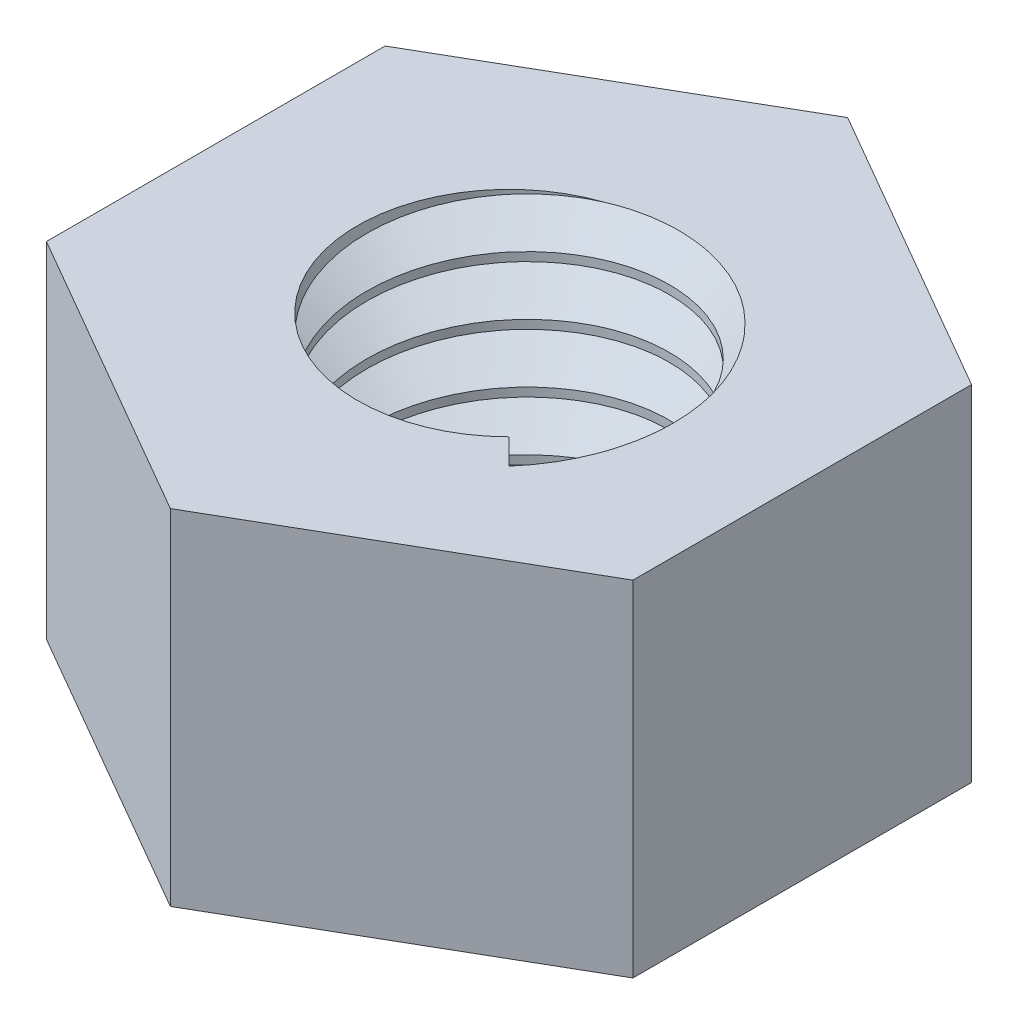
ISO-10303-21;
HEADER;
FILE_DESCRIPTION(('STEP AP214'),'2;1');
FILE_NAME('part.step','',(''),(''),'','','');
FILE_SCHEMA(('AUTOMOTIVE_DESIGN { 1 0 10303 214 1 1 1 1 }'));
ENDSEC;
DATA;
#1=APPLICATION_CONTEXT('core data for automotive mechanical design processes');
#2=APPLICATION_PROTOCOL_DEFINITION('international standard','automotive_design',2000,#1);
#3=PRODUCT_CONTEXT('',#1,'mechanical');
#4=PRODUCT('Part','Part','',(#3));
#5=PRODUCT_RELATED_PRODUCT_CATEGORY('part','',(#4));
#6=PRODUCT_DEFINITION_FORMATION('','',#4);
#7=PRODUCT_DEFINITION_CONTEXT('part definition',#1,'design');
#8=PRODUCT_DEFINITION('design','',#6,#7);
#9=PRODUCT_DEFINITION_SHAPE('','',#8);
#10=(LENGTH_UNIT() NAMED_UNIT(*) SI_UNIT(.MILLI.,.METRE.));
#11=(NAMED_UNIT(*) PLANE_ANGLE_UNIT() SI_UNIT($,.RADIAN.));
#12=(NAMED_UNIT(*) SI_UNIT($,.STERADIAN.) SOLID_ANGLE_UNIT());
#13=UNCERTAINTY_MEASURE_WITH_UNIT(LENGTH_MEASURE(1.E-05),#10,'distance_accuracy_value','');
#14=(GEOMETRIC_REPRESENTATION_CONTEXT(3) GLOBAL_UNCERTAINTY_ASSIGNED_CONTEXT((#13)) GLOBAL_UNIT_ASSIGNED_CONTEXT((#10,
#11,#12)) REPRESENTATION_CONTEXT('',''));
#15=CARTESIAN_POINT('',(0.,0.,0.));
#16=DIRECTION('',(0.,0.,1.));
#17=DIRECTION('',(1.,0.,0.));
#18=AXIS2_PLACEMENT_3D('',#15,#16,#17);
#19=CARTESIAN_POINT('',(0.,0.,0.));
#20=DIRECTION('',(0.,-1.,0.));
#21=DIRECTION('',(0.,0.,-1.));
#22=AXIS2_PLACEMENT_3D('',#19,#20,#21);
#23=PLANE('',#22);
#24=DIRECTION('',(0.,0.,-1.));
#25=VECTOR('',#24,1.);
#26=CARTESIAN_POINT('',(4.,0.,-2.30940107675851));
#27=LINE('',#26,#25);
#28=CARTESIAN_POINT('',(4.,0.,2.3094010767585));
#29=VERTEX_POINT('',#28);
#30=CARTESIAN_POINT('',(4.,0.,-2.30940107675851));
#31=VERTEX_POINT('',#30);
#32=EDGE_CURVE('E136',#29,#31,#27,.T.);
#33=ORIENTED_EDGE('',*,*,#32,.F.);
#34=DIRECTION('',(0.866025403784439,0.,-0.5));
#35=VECTOR('',#34,1.);
#36=CARTESIAN_POINT('',(4.,0.,2.3094010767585));
#37=LINE('',#36,#35);
#38=CARTESIAN_POINT('',(0.,0.,4.61880215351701));
#39=VERTEX_POINT('',#38);
#40=EDGE_CURVE('E90',#39,#29,#37,.T.);
#41=ORIENTED_EDGE('',*,*,#40,.F.);
#42=DIRECTION('',(0.866025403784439,0.,0.5));
#43=VECTOR('',#42,1.);
#44=CARTESIAN_POINT('',(0.,0.,4.61880215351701));
#45=LINE('',#44,#43);
#46=CARTESIAN_POINT('',(-4.,0.,2.3094010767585));
#47=VERTEX_POINT('',#46);
#48=EDGE_CURVE('E145',#47,#39,#45,.T.);
#49=ORIENTED_EDGE('',*,*,#48,.F.);
#50=DIRECTION('',(0.,0.,1.));
#51=VECTOR('',#50,1.);
#52=CARTESIAN_POINT('',(-4.,0.,2.3094010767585));
#53=LINE('',#52,#51);
#54=CARTESIAN_POINT('',(-4.,0.,-2.3094010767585));
#55=VERTEX_POINT('',#54);
#56=EDGE_CURVE('E124',#55,#47,#53,.T.);
#57=ORIENTED_EDGE('',*,*,#56,.F.);
#58=DIRECTION('',(-0.866025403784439,0.,0.5));
#59=VECTOR('',#58,1.);
#60=CARTESIAN_POINT('',(-4.,0.,-2.3094010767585));
#61=LINE('',#60,#59);
#62=CARTESIAN_POINT('',(0.,0.,-4.61880215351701));
#63=VERTEX_POINT('',#62);
#64=EDGE_CURVE('E142',#63,#55,#61,.T.);
#65=ORIENTED_EDGE('',*,*,#64,.F.);
#66=DIRECTION('',(-0.866025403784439,0.,-0.5));
#67=VECTOR('',#66,1.);
#68=CARTESIAN_POINT('',(0.,0.,-4.61880215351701));
#69=LINE('',#68,#67);
#70=EDGE_CURVE('E139',#31,#63,#69,.T.);
#71=ORIENTED_EDGE('',*,*,#70,.F.);
#72=EDGE_LOOP('',(#33,#41,#49,#57,#65,#71));
#73=FACE_BOUND('',#72,.T.);
#74=CARTESIAN_POINT('',(0.,0.,-1.98208));
#75=CARTESIAN_POINT('',(-0.0573510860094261,0.,-1.98710680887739));
#76=CARTESIAN_POINT('',(-0.114889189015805,0.,-1.9897102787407));
#77=CARTESIAN_POINT('',(-0.229979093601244,0.,-1.99006469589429));
#78=CARTESIAN_POINT('',(-0.287530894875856,0.,-1.98781574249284));
#79=CARTESIAN_POINT('',(-0.45951404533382,0.,-1.97379434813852));
#80=CARTESIAN_POINT('',(-0.573430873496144,0.,-1.9547610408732));
#81=CARTESIAN_POINT('',(-0.796475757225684,0.,-1.89779706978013));
#82=CARTESIAN_POINT('',(-0.905602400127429,0.,-1.85986087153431));
#83=CARTESIAN_POINT('',(-1.06323415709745,0.,-1.78970155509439));
#84=CARTESIAN_POINT('',(-1.11477601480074,0.,-1.76410087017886));
#85=CARTESIAN_POINT('',(-1.21553021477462,0.,-1.70865091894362));
#86=CARTESIAN_POINT('',(-1.26474280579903,0.,-1.67880210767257));
#87=CARTESIAN_POINT('',(-1.36042467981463,0.,-1.61510833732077));
#88=CARTESIAN_POINT('',(-1.40689710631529,0.,-1.58126809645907));
#89=CARTESIAN_POINT('',(-1.4968374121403,0.,-1.50980522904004));
#90=CARTESIAN_POINT('',(-1.54030491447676,0.,-1.47218212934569));
#91=CARTESIAN_POINT('',(-1.62420936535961,0.,-1.39364460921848));
#92=CARTESIAN_POINT('',(-1.66464429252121,0.,-1.35272803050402));
#93=CARTESIAN_POINT('',(-1.74216892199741,0.,-1.26783300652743));
#94=CARTESIAN_POINT('',(-1.77925757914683,0.,-1.22385361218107));
#95=CARTESIAN_POINT('',(-1.88833852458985,-1.45927890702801E-13,-1.08363515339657));
#96=CARTESIAN_POINT('',(-1.95436437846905,0.,-0.982634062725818));
#97=CARTESIAN_POINT('',(-2.06887657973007,0.,-0.771305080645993));
#98=CARTESIAN_POINT('',(-2.1173749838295,0.,-0.660983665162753));
#99=CARTESIAN_POINT('',(-2.19665902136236,0.,-0.431066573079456));
#100=CARTESIAN_POINT('',(-2.22698060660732,0.,-0.311309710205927));
#101=CARTESIAN_POINT('',(-2.26701244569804,0.,-0.0683643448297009));
#102=CARTESIAN_POINT('',(-2.27670731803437,0.,0.0548266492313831));
#103=CARTESIAN_POINT('',(-2.27667354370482,0.,0.302888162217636));
#104=CARTESIAN_POINT('',(-2.26667152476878,0.,0.427758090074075));
#105=CARTESIAN_POINT('',(-2.2268140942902,0.,0.674281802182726));
#106=CARTESIAN_POINT('',(-2.19696217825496,0.,0.795936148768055));
#107=CARTESIAN_POINT('',(-2.11620114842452,0.,1.03897826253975));
#108=CARTESIAN_POINT('',(-2.06429200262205,0.,1.16003335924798));
#109=CARTESIAN_POINT('',(-1.94082276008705,0.,1.39179457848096));
#110=CARTESIAN_POINT('',(-1.8692617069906,0.,1.50250019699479));
#111=CARTESIAN_POINT('',(-1.76901229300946,0.,1.63221002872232));
#112=CARTESIAN_POINT('',(-1.74842759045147,0.,1.65771252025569));
#113=CARTESIAN_POINT('',(-1.706210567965,0.,1.70783352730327));
#114=CARTESIAN_POINT('',(-1.68457840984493,0.,1.7324521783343));
#115=CARTESIAN_POINT('',(-1.61824869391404,0.,1.80500696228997));
#116=CARTESIAN_POINT('',(-1.57211687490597,0.,1.85164323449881));
#117=CARTESIAN_POINT('',(-1.47627314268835,0.,1.94112794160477));
#118=CARTESIAN_POINT('',(-1.42655943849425,0.,1.98397445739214));
#119=CARTESIAN_POINT('',(-1.32391152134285,0.,2.06558493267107));
#120=CARTESIAN_POINT('',(-1.27097754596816,0.,2.10434919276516));
#121=CARTESIAN_POINT('',(-1.1021205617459,0.,2.21797410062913));
#122=CARTESIAN_POINT('',(-0.981124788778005,0.,2.28548426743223));
#123=CARTESIAN_POINT('',(-0.729713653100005,0.,2.3993615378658));
#124=CARTESIAN_POINT('',(-0.599306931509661,0.,2.44574775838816));
#125=CARTESIAN_POINT('',(-0.389758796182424,0.,2.50115110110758));
#126=CARTESIAN_POINT('',(-0.312529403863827,0.,2.51766631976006));
#127=CARTESIAN_POINT('',(-0.156961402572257,0.,2.54325805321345));
#128=CARTESIAN_POINT('',(-0.0786245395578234,0.,2.55234518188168));
#129=CARTESIAN_POINT('',(0.,0.,2.55768));
#130=B_SPLINE_CURVE_WITH_KNOTS('',3,(#74,#75,#76,#77,#78,#79,#80,#81,#82,#83,#84,#85,#86,#87,
#88,#89,#90,#91,#92,#93,#94,#95,#96,#97,#98,#99,#100,#101,#102,#103,#104,#105,#106,#107,#108,
#109,#110,#111,#112,#113,#114,#115,#116,#117,#118,#119,#120,#121,#122,#123,#124,#125,#126,#127,
#128,#129),.UNSPECIFIED.,.F.,.F.,(4,2,2,2,2,2,2,2,2,2,2,2,2,2,2,2,2,2,2,2,2,2,2,2,2,2,2,4),(0.,
0.172611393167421,0.345219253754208,0.689966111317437,1.03481396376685,1.2072922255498,
1.37975202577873,1.5520099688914,1.72428948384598,1.89668283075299,2.06912983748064,
2.42934257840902,2.78930706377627,3.15810813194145,3.52718412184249,3.90141860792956,
4.27558720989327,4.66891653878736,5.06226501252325,5.16057110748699,5.25886206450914,
5.45543901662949,5.65211495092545,5.84877639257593,6.26237072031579,6.67559000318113,
6.91219031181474,7.14845195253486),.UNSPECIFIED.);
#131=CARTESIAN_POINT('',(-0.920858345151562,0.,-1.8505428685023));
#132=VERTEX_POINT('',#131);
#133=CARTESIAN_POINT('',(0.,0.,2.55768));
#134=VERTEX_POINT('',#133);
#135=EDGE_CURVE('E190',#132,#134,#130,.T.);
#136=ORIENTED_EDGE('',*,*,#135,.T.);
#137=DIRECTION('',(0.,0.,-1.));
#138=VECTOR('',#137,1.);
#139=CARTESIAN_POINT('',(0.,0.,0.));
#140=LINE('',#139,#138);
#141=CARTESIAN_POINT('',(0.,0.,2.067));
#142=VERTEX_POINT('',#141);
#143=EDGE_CURVE('E161',#134,#142,#140,.T.);
#144=ORIENTED_EDGE('',*,*,#143,.T.);
#145=CARTESIAN_POINT('',(0.,0.,0.));
#146=DIRECTION('',(0.,-1.,0.));
#147=DIRECTION('',(0.,0.,-1.));
#148=AXIS2_PLACEMENT_3D('',#145,#146,#147);
#149=CIRCLE('',#148,2.067);
#150=EDGE_CURVE('E158',#132,#142,#149,.T.);
#151=ORIENTED_EDGE('',*,*,#150,.F.);
#152=EDGE_LOOP('',(#136,#144,#151));
#153=FACE_BOUND('',#152,.T.);
#154=ADVANCED_FACE('F39',(#73,#153),#23,.T.);
#155=CARTESIAN_POINT('',(4.,4.7,-2.30940107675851));
#156=DIRECTION('',(-1.,0.,0.));
#157=DIRECTION('',(0.,0.,1.));
#158=AXIS2_PLACEMENT_3D('',#155,#156,#157);
#159=PLANE('',#158);
#160=ORIENTED_EDGE('',*,*,#32,.T.);
#161=DIRECTION('',(0.,-1.,0.));
#162=VECTOR('',#161,1.);
#163=CARTESIAN_POINT('',(4.,4.7,-2.30940107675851));
#164=LINE('',#163,#162);
#165=CARTESIAN_POINT('',(4.,4.7,-2.30940107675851));
#166=VERTEX_POINT('',#165);
#167=EDGE_CURVE('E155',#166,#31,#164,.T.);
#168=ORIENTED_EDGE('',*,*,#167,.F.);
#169=DIRECTION('',(0.,0.,-1.));
#170=VECTOR('',#169,1.);
#171=CARTESIAN_POINT('',(4.,4.7,-2.30940107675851));
#172=LINE('',#171,#170);
#173=CARTESIAN_POINT('',(4.,4.7,2.3094010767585));
#174=VERTEX_POINT('',#173);
#175=EDGE_CURVE('E148',#174,#166,#172,.T.);
#176=ORIENTED_EDGE('',*,*,#175,.F.);
#177=DIRECTION('',(0.,-1.,0.));
#178=VECTOR('',#177,1.);
#179=CARTESIAN_POINT('',(4.,4.7,2.3094010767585));
#180=LINE('',#179,#178);
#181=EDGE_CURVE('E132',#174,#29,#180,.T.);
#182=ORIENTED_EDGE('',*,*,#181,.T.);
#183=EDGE_LOOP('',(#160,#168,#176,#182));
#184=FACE_BOUND('',#183,.T.);
#185=ADVANCED_FACE('F41',(#184),#159,.F.);
#186=CARTESIAN_POINT('',(0.,4.7,-4.61880215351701));
#187=DIRECTION('',(-0.5,0.,0.866025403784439));
#188=DIRECTION('',(0.866025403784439,0.,0.5));
#189=AXIS2_PLACEMENT_3D('',#186,#187,#188);
#190=PLANE('',#189);
#191=ORIENTED_EDGE('',*,*,#70,.T.);
#192=DIRECTION('',(0.,-1.,0.));
#193=VECTOR('',#192,1.);
#194=CARTESIAN_POINT('',(0.,4.7,-4.61880215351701));
#195=LINE('',#194,#193);
#196=CARTESIAN_POINT('',(0.,4.7,-4.61880215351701));
#197=VERTEX_POINT('',#196);
#198=EDGE_CURVE('E152',#197,#63,#195,.T.);
#199=ORIENTED_EDGE('',*,*,#198,.F.);
#200=DIRECTION('',(-0.866025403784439,0.,-0.5));
#201=VECTOR('',#200,1.);
#202=CARTESIAN_POINT('',(0.,4.7,-4.61880215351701));
#203=LINE('',#202,#201);
#204=EDGE_CURVE('E99',#166,#197,#203,.T.);
#205=ORIENTED_EDGE('',*,*,#204,.F.);
#206=ORIENTED_EDGE('',*,*,#167,.T.);
#207=EDGE_LOOP('',(#191,#199,#205,#206));
#208=FACE_BOUND('',#207,.T.);
#209=ADVANCED_FACE('F216',(#208),#190,.F.);
#210=CARTESIAN_POINT('',(-4.,4.7,-2.3094010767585));
#211=DIRECTION('',(0.5,0.,0.866025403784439));
#212=DIRECTION('',(0.866025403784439,0.,-0.5));
#213=AXIS2_PLACEMENT_3D('',#210,#211,#212);
#214=PLANE('',#213);
#215=ORIENTED_EDGE('',*,*,#64,.T.);
#216=DIRECTION('',(0.,-1.,0.));
#217=VECTOR('',#216,1.);
#218=CARTESIAN_POINT('',(-4.,4.7,-2.3094010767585));
#219=LINE('',#218,#217);
#220=CARTESIAN_POINT('',(-4.,4.7,-2.3094010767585));
#221=VERTEX_POINT('',#220);
#222=EDGE_CURVE('E127',#221,#55,#219,.T.);
#223=ORIENTED_EDGE('',*,*,#222,.F.);
#224=DIRECTION('',(-0.866025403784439,0.,0.5));
#225=VECTOR('',#224,1.);
#226=CARTESIAN_POINT('',(-4.,4.7,-2.3094010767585));
#227=LINE('',#226,#225);
#228=EDGE_CURVE('E115',#197,#221,#227,.T.);
#229=ORIENTED_EDGE('',*,*,#228,.F.);
#230=ORIENTED_EDGE('',*,*,#198,.T.);
#231=EDGE_LOOP('',(#215,#223,#229,#230));
#232=FACE_BOUND('',#231,.T.);
#233=ADVANCED_FACE('F219',(#232),#214,.F.);
#234=CARTESIAN_POINT('',(-4.,4.7,2.3094010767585));
#235=DIRECTION('',(1.,0.,0.));
#236=DIRECTION('',(0.,0.,-1.));
#237=AXIS2_PLACEMENT_3D('',#234,#235,#236);
#238=PLANE('',#237);
#239=ORIENTED_EDGE('',*,*,#56,.T.);
#240=DIRECTION('',(0.,-1.,0.));
#241=VECTOR('',#240,1.);
#242=CARTESIAN_POINT('',(-4.,4.7,2.3094010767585));
#243=LINE('',#242,#241);
#244=CARTESIAN_POINT('',(-4.,4.7,2.3094010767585));
#245=VERTEX_POINT('',#244);
#246=EDGE_CURVE('E121',#245,#47,#243,.T.);
#247=ORIENTED_EDGE('',*,*,#246,.F.);
#248=DIRECTION('',(0.,0.,1.));
#249=VECTOR('',#248,1.);
#250=CARTESIAN_POINT('',(-4.,4.7,2.3094010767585));
#251=LINE('',#250,#249);
#252=EDGE_CURVE('E108',#221,#245,#251,.T.);
#253=ORIENTED_EDGE('',*,*,#252,.F.);
#254=ORIENTED_EDGE('',*,*,#222,.T.);
#255=EDGE_LOOP('',(#239,#247,#253,#254));
#256=FACE_BOUND('',#255,.T.);
#257=ADVANCED_FACE('F122',(#256),#238,.F.);
#258=CARTESIAN_POINT('',(0.,4.7,4.61880215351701));
#259=DIRECTION('',(0.5,0.,-0.866025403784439));
#260=DIRECTION('',(-0.866025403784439,0.,-0.5));
#261=AXIS2_PLACEMENT_3D('',#258,#259,#260);
#262=PLANE('',#261);
#263=ORIENTED_EDGE('',*,*,#48,.T.);
#264=DIRECTION('',(0.,-1.,0.));
#265=VECTOR('',#264,1.);
#266=CARTESIAN_POINT('',(0.,4.7,4.61880215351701));
#267=LINE('',#266,#265);
#268=CARTESIAN_POINT('',(0.,4.7,4.61880215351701));
#269=VERTEX_POINT('',#268);
#270=EDGE_CURVE('E128',#269,#39,#267,.T.);
#271=ORIENTED_EDGE('',*,*,#270,.F.);
#272=DIRECTION('',(0.866025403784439,0.,0.5));
#273=VECTOR('',#272,1.);
#274=CARTESIAN_POINT('',(0.,4.7,4.61880215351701));
#275=LINE('',#274,#273);
#276=EDGE_CURVE('E112',#245,#269,#275,.T.);
#277=ORIENTED_EDGE('',*,*,#276,.F.);
#278=ORIENTED_EDGE('',*,*,#246,.T.);
#279=EDGE_LOOP('',(#263,#271,#277,#278));
#280=FACE_BOUND('',#279,.T.);
#281=ADVANCED_FACE('F130',(#280),#262,.F.);
#282=CARTESIAN_POINT('',(4.,4.7,2.3094010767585));
#283=DIRECTION('',(-0.5,0.,-0.866025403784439));
#284=DIRECTION('',(-0.866025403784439,0.,0.5));
#285=AXIS2_PLACEMENT_3D('',#282,#283,#284);
#286=PLANE('',#285);
#287=ORIENTED_EDGE('',*,*,#40,.T.);
#288=ORIENTED_EDGE('',*,*,#181,.F.);
#289=DIRECTION('',(0.866025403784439,0.,-0.5));
#290=VECTOR('',#289,1.);
#291=CARTESIAN_POINT('',(4.,4.7,2.3094010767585));
#292=LINE('',#291,#290);
#293=EDGE_CURVE('E63',#269,#174,#292,.T.);
#294=ORIENTED_EDGE('',*,*,#293,.F.);
#295=ORIENTED_EDGE('',*,*,#270,.T.);
#296=EDGE_LOOP('',(#287,#288,#294,#295));
#297=FACE_BOUND('',#296,.T.);
#298=ADVANCED_FACE('F223',(#297),#286,.F.);
#299=CARTESIAN_POINT('',(0.,4.7,0.));
#300=DIRECTION('',(0.,-1.,0.));
#301=DIRECTION('',(0.,0.,-1.));
#302=AXIS2_PLACEMENT_3D('',#299,#300,#301);
#303=PLANE('',#302);
#304=CARTESIAN_POINT('',(1.80855287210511,4.7,1.8085528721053));
#305=CARTESIAN_POINT('',(1.84977082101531,4.69999999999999,1.76133049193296));
#306=CARTESIAN_POINT('',(1.8891847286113,4.7,1.71256006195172));
#307=CARTESIAN_POINT('',(1.96420685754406,4.7,1.61218457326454));
#308=CARTESIAN_POINT('',(1.9998155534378,4.70000000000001,1.56057986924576));
#309=CARTESIAN_POINT('',(2.10058476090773,4.69999999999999,1.40199441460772));
#310=CARTESIAN_POINT('',(2.15977195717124,4.69999999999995,1.29114642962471));
#311=CARTESIAN_POINT('',(2.26641501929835,4.69999999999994,1.04876457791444));
#312=CARTESIAN_POINT('',(2.31179273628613,4.69999999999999,0.91630806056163));
#313=CARTESIAN_POINT('',(2.36268713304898,4.70000000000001,0.713437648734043));
#314=CARTESIAN_POINT('',(2.37679368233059,4.7,0.645068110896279));
#315=CARTESIAN_POINT('',(2.39919810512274,4.7,0.507363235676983));
#316=CARTESIAN_POINT('',(2.40749565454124,4.7,0.438027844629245));
#317=CARTESIAN_POINT('',(2.41821480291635,4.7,0.29888825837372));
#318=CARTESIAN_POINT('',(2.42063540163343,4.7,0.22908398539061));
#319=CARTESIAN_POINT('',(2.41984329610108,4.7,0.124429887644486));
#320=CARTESIAN_POINT('',(2.4188418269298,4.7,0.0895510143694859));
#321=CARTESIAN_POINT('',(2.41537802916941,4.7,0.0198661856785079));
#322=CARTESIAN_POINT('',(2.41291571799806,4.7,-0.0149397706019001));
#323=CARTESIAN_POINT('',(2.40319097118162,4.7,-0.119098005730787));
#324=CARTESIAN_POINT('',(2.3935905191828,4.7,-0.188249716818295));
#325=CARTESIAN_POINT('',(2.36826081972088,4.7,-0.325389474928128));
#326=CARTESIAN_POINT('',(2.35253172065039,4.7,-0.393377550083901));
#327=CARTESIAN_POINT('',(2.29750303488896,4.7,-0.59050103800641));
#328=CARTESIAN_POINT('',(2.24991135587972,4.7,-0.71742274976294));
#329=CARTESIAN_POINT('',(2.13346234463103,4.7,-0.961209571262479));
#330=CARTESIAN_POINT('',(2.06459150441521,4.7,-1.07806823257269));
#331=CARTESIAN_POINT('',(1.94811103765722,4.7,-1.24151094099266));
#332=CARTESIAN_POINT('',(1.90773092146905,4.7,-1.29338038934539));
#333=CARTESIAN_POINT('',(1.82274144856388,4.7,-1.39353860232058));
#334=CARTESIAN_POINT('',(1.77813341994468,4.7,-1.4418284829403));
#335=CARTESIAN_POINT('',(1.70830790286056,4.7,-1.51128426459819));
#336=CARTESIAN_POINT('',(1.68454922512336,4.7,-1.53393794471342));
#337=CARTESIAN_POINT('',(1.63611441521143,4.7,-1.57823277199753));
#338=CARTESIAN_POINT('',(1.61143852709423,4.7,-1.59987418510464));
#339=CARTESIAN_POINT('',(1.53600907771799,4.7,-1.66310825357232));
#340=CARTESIAN_POINT('',(1.48384154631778,4.7,-1.70302295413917));
#341=CARTESIAN_POINT('',(1.32394291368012,4.70000000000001,-1.81432076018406));
#342=CARTESIAN_POINT('',(1.21128750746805,4.7,-1.87878542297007));
#343=CARTESIAN_POINT('',(0.9763284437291,4.7,-1.98686617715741));
#344=CARTESIAN_POINT('',(0.854021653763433,4.7,-2.03047546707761));
#345=CARTESIAN_POINT('',(0.669320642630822,4.7,-2.07844946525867));
#346=CARTESIAN_POINT('',(0.609047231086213,4.7,-2.09141062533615));
#347=CARTESIAN_POINT('',(0.487606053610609,4.7,-2.11221207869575));
#348=CARTESIAN_POINT('',(0.426438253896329,4.7,-2.12005217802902));
#349=CARTESIAN_POINT('',(0.303674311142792,4.7,-2.13054745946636));
#350=CARTESIAN_POINT('',(0.242078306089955,4.7,-2.13320424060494));
#351=CARTESIAN_POINT('',(0.149698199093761,4.7,-2.13328578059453));
#352=CARTESIAN_POINT('',(0.118904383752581,4.7,-2.13266212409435));
#353=CARTESIAN_POINT('',(0.0573672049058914,4.7,-2.13013114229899));
#354=CARTESIAN_POINT('',(0.0266238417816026,4.7,-2.12822380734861));
#355=CARTESIAN_POINT('',(-0.0348267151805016,4.7,-2.12305766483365));
#356=CARTESIAN_POINT('',(-0.0655336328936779,4.7,-2.11979553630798));
#357=CARTESIAN_POINT('',(-0.126763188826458,4.7,-2.1118785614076));
#358=CARTESIAN_POINT('',(-0.157285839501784,4.7,-2.10722381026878));
#359=CARTESIAN_POINT('',(-0.248490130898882,4.7,-2.09119975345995));
#360=CARTESIAN_POINT('',(-0.308822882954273,4.7,-2.07776940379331));
#361=CARTESIAN_POINT('',(-0.428011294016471,4.7,-2.04551399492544));
#362=CARTESIAN_POINT('',(-0.486867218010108,4.7,-2.02668991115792));
#363=CARTESIAN_POINT('',(-0.60264662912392,4.7,-1.9838021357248));
#364=CARTESIAN_POINT('',(-0.659569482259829,4.7,-1.95973674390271));
#365=CARTESIAN_POINT('',(-0.819255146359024,4.7,-1.88351542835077));
#366=CARTESIAN_POINT('',(-0.919088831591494,4.7,-1.8250648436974));
#367=CARTESIAN_POINT('',(-1.10734719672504,4.7,-1.69226906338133));
#368=CARTESIAN_POINT('',(-1.19579050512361,4.7,-1.61795036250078));
#369=CARTESIAN_POINT('',(-1.29900584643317,4.7,-1.5152298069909));
#370=CARTESIAN_POINT('',(-1.32024422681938,4.7,-1.49311850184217));
#371=CARTESIAN_POINT('',(-1.36167379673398,4.7,-1.44800056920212));
#372=CARTESIAN_POINT('',(-1.38186660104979,4.69999999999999,-1.42499542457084));
#373=CARTESIAN_POINT('',(-1.4015422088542,4.69999999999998,-1.40154220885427));
#374=B_SPLINE_CURVE_WITH_KNOTS('',3,(#304,#305,#306,#307,#308,#309,#310,#311,#312,#313,#314,
#315,#316,#317,#318,#319,#320,#321,#322,#323,#324,#325,#326,#327,#328,#329,#330,#331,#332,#333,
#334,#335,#336,#337,#338,#339,#340,#341,#342,#343,#344,#345,#346,#347,#348,#349,#350,#351,#352,
#353,#354,#355,#356,#357,#358,#359,#360,#361,#362,#363,#364,#365,#366,#367,#368,#369,#370,#371,
#372,#373),.UNSPECIFIED.,.F.,.F.,(4,2,2,2,2,2,2,2,2,2,2,2,2,2,2,2,2,2,2,2,2,2,2,2,2,2,2,2,2,2,2,
2,2,2,4),(0.,0.187957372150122,0.375891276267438,0.751381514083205,1.16925348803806,
1.37847744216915,1.58771306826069,1.796984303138,1.90163729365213,2.00628903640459,
2.21541594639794,2.42453779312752,2.82902868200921,3.23377687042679,3.43079223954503,
3.62774592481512,3.72620657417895,3.82464120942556,4.0214589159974,4.40870514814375,
4.79607758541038,4.98085065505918,5.16563072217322,5.35035377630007,5.44273188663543,
5.5351106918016,5.62771729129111,5.72031755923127,5.90547378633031,6.09059654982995,
6.27577945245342,6.621108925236,6.96586625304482,7.05782363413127,7.14963447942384),.UNSPECIFIED.);
#375=CARTESIAN_POINT('',(1.80855287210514,4.69999999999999,1.80855287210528));
#376=VERTEX_POINT('',#375);
#377=CARTESIAN_POINT('',(-0.65738623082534,4.7,-1.95967659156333));
#378=VERTEX_POINT('',#377);
#379=EDGE_CURVE('E54',#376,#378,#374,.T.);
#380=ORIENTED_EDGE('',*,*,#379,.F.);
#381=DIRECTION('',(-0.707106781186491,0.,-0.707106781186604));
#382=VECTOR('',#381,1.);
#383=CARTESIAN_POINT('',(0.,4.7,0.));
#384=LINE('',#383,#382);
#385=CARTESIAN_POINT('',(1.46158971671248,4.7,1.46158971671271));
#386=VERTEX_POINT('',#385);
#387=EDGE_CURVE('E201',#376,#386,#384,.T.);
#388=ORIENTED_EDGE('',*,*,#387,.T.);
#389=CARTESIAN_POINT('',(0.,4.7,0.));
#390=DIRECTION('',(0.,-1.,0.));
#391=DIRECTION('',(0.,0.,-1.));
#392=AXIS2_PLACEMENT_3D('',#389,#390,#391);
#393=CIRCLE('',#392,2.067);
#394=EDGE_CURVE('E140',#386,#378,#393,.T.);
#395=ORIENTED_EDGE('',*,*,#394,.T.);
#396=EDGE_LOOP('',(#380,#388,#395));
#397=FACE_BOUND('',#396,.T.);
#398=ORIENTED_EDGE('',*,*,#175,.T.);
#399=ORIENTED_EDGE('',*,*,#204,.T.);
#400=ORIENTED_EDGE('',*,*,#228,.T.);
#401=ORIENTED_EDGE('',*,*,#252,.T.);
#402=ORIENTED_EDGE('',*,*,#276,.T.);
#403=ORIENTED_EDGE('',*,*,#293,.T.);
#404=EDGE_LOOP('',(#398,#399,#400,#401,#402,#403));
#405=FACE_BOUND('',#404,.T.);
#406=ADVANCED_FACE('F110',(#397,#405),#303,.F.);
#407=CARTESIAN_POINT('',(0.,-1.,0.));
#408=DIRECTION('',(0.,1.,0.));
#409=DIRECTION('',(0.,0.,1.));
#410=AXIS2_PLACEMENT_3D('',#407,#408,#409);
#411=CYLINDRICAL_SURFACE('',#410,2.067);
#412=ORIENTED_EDGE('',*,*,#394,.F.);
#413=DIRECTION('',(0.,1.,0.));
#414=VECTOR('',#413,1.);
#415=CARTESIAN_POINT('',(1.46158971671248,-1.,1.46158971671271));
#416=LINE('',#415,#414);
#417=CARTESIAN_POINT('',(1.46158971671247,4.35901320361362,1.46158971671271));
#418=VERTEX_POINT('',#417);
#419=EDGE_CURVE('E12',#386,#418,#416,.F.);
#420=ORIENTED_EDGE('',*,*,#419,.T.);
#421=CARTESIAN_POINT('',(0.,-0.340986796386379,2.067));
#422=CARTESIAN_POINT('',(-0.856179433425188,-0.290986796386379,2.067));
#423=CARTESIAN_POINT('',(-1.46158971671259,-0.240986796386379,1.46158971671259));
#424=CARTESIAN_POINT('',(-2.067,-0.19098679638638,0.856179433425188));
#425=CARTESIAN_POINT('',(-2.067,-0.14098679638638,0.));
#426=CARTESIAN_POINT('',(-2.067,-0.0909867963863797,-0.856179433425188));
#427=CARTESIAN_POINT('',(-1.46158971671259,-0.0409867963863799,-1.46158971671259));
#428=CARTESIAN_POINT('',(-0.856179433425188,0.00901320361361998,-2.067));
#429=CARTESIAN_POINT('',(0.,0.0590132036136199,-2.067));
#430=CARTESIAN_POINT('',(0.856179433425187,0.10901320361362,-2.067));
#431=CARTESIAN_POINT('',(1.46158971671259,0.15901320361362,-1.46158971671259));
#432=CARTESIAN_POINT('',(2.067,0.20901320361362,-0.856179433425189));
#433=CARTESIAN_POINT('',(2.067,0.259013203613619,0.));
#434=CARTESIAN_POINT('',(2.067,0.309013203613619,0.856179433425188));
#435=CARTESIAN_POINT('',(1.46158971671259,0.359013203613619,1.46158971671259));
#436=CARTESIAN_POINT('',(0.856179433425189,0.409013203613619,2.067));
#437=CARTESIAN_POINT('',(0.,0.459013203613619,2.067));
#438=CARTESIAN_POINT('',(-0.856179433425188,0.509013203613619,2.067));
#439=CARTESIAN_POINT('',(-1.46158971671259,0.559013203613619,1.46158971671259));
#440=CARTESIAN_POINT('',(-2.067,0.609013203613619,0.856179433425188));
#441=CARTESIAN_POINT('',(-2.067,0.659013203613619,0.));
#442=CARTESIAN_POINT('',(-2.067,0.709013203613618,-0.856179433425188));
#443=CARTESIAN_POINT('',(-1.46158971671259,0.759013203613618,-1.46158971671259));
#444=CARTESIAN_POINT('',(-0.856179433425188,0.809013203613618,-2.067));
#445=CARTESIAN_POINT('',(0.,0.859013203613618,-2.067));
#446=CARTESIAN_POINT('',(0.856179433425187,0.909013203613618,-2.067));
#447=CARTESIAN_POINT('',(1.46158971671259,0.959013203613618,-1.46158971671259));
#448=CARTESIAN_POINT('',(2.067,1.00901320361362,-0.856179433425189));
#449=CARTESIAN_POINT('',(2.067,1.05901320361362,0.));
#450=CARTESIAN_POINT('',(2.067,1.10901320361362,0.856179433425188));
#451=CARTESIAN_POINT('',(1.46158971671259,1.15901320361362,1.46158971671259));
#452=CARTESIAN_POINT('',(0.856179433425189,1.20901320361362,2.067));
#453=CARTESIAN_POINT('',(0.,1.25901320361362,2.067));
#454=CARTESIAN_POINT('',(-0.856179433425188,1.30901320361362,2.067));
#455=CARTESIAN_POINT('',(-1.46158971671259,1.35901320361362,1.46158971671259));
#456=CARTESIAN_POINT('',(-2.067,1.40901320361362,0.856179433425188));
#457=CARTESIAN_POINT('',(-2.067,1.45901320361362,0.));
#458=CARTESIAN_POINT('',(-2.067,1.50901320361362,-0.856179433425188));
#459=CARTESIAN_POINT('',(-1.46158971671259,1.55901320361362,-1.46158971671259));
#460=CARTESIAN_POINT('',(-0.856179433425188,1.60901320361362,-2.067));
#461=CARTESIAN_POINT('',(0.,1.65901320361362,-2.067));
#462=CARTESIAN_POINT('',(0.856179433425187,1.70901320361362,-2.067));
#463=CARTESIAN_POINT('',(1.46158971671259,1.75901320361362,-1.46158971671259));
#464=CARTESIAN_POINT('',(2.067,1.80901320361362,-0.856179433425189));
#465=CARTESIAN_POINT('',(2.067,1.85901320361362,0.));
#466=CARTESIAN_POINT('',(2.067,1.90901320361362,0.856179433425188));
#467=CARTESIAN_POINT('',(1.46158971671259,1.95901320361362,1.46158971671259));
#468=CARTESIAN_POINT('',(0.856179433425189,2.00901320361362,2.067));
#469=CARTESIAN_POINT('',(0.,2.05901320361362,2.067));
#470=CARTESIAN_POINT('',(-0.856179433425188,2.10901320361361,2.067));
#471=CARTESIAN_POINT('',(-1.46158971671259,2.15901320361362,1.46158971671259));
#472=CARTESIAN_POINT('',(-2.067,2.20901320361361,0.856179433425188));
#473=CARTESIAN_POINT('',(-2.067,2.25901320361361,0.));
#474=CARTESIAN_POINT('',(-2.067,2.30901320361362,-0.856179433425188));
#475=CARTESIAN_POINT('',(-1.46158971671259,2.35901320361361,-1.46158971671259));
#476=CARTESIAN_POINT('',(-0.856179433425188,2.40901320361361,-2.067));
#477=CARTESIAN_POINT('',(0.,2.45901320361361,-2.067));
#478=CARTESIAN_POINT('',(0.856179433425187,2.50901320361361,-2.067));
#479=CARTESIAN_POINT('',(1.46158971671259,2.55901320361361,-1.46158971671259));
#480=CARTESIAN_POINT('',(2.067,2.60901320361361,-0.856179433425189));
#481=CARTESIAN_POINT('',(2.067,2.65901320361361,0.));
#482=CARTESIAN_POINT('',(2.067,2.70901320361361,0.856179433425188));
#483=CARTESIAN_POINT('',(1.46158971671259,2.75901320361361,1.46158971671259));
#484=CARTESIAN_POINT('',(0.856179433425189,2.80901320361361,2.067));
#485=CARTESIAN_POINT('',(0.,2.85901320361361,2.067));
#486=CARTESIAN_POINT('',(-0.856179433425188,2.90901320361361,2.067));
#487=CARTESIAN_POINT('',(-1.46158971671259,2.95901320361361,1.46158971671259));
#488=CARTESIAN_POINT('',(-2.067,3.00901320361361,0.856179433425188));
#489=CARTESIAN_POINT('',(-2.067,3.05901320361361,0.));
#490=CARTESIAN_POINT('',(-2.067,3.10901320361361,-0.856179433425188));
#491=CARTESIAN_POINT('',(-1.46158971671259,3.15901320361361,-1.46158971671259));
#492=CARTESIAN_POINT('',(-0.856179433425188,3.20901320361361,-2.067));
#493=CARTESIAN_POINT('',(0.,3.25901320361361,-2.067));
#494=CARTESIAN_POINT('',(0.856179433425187,3.30901320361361,-2.067));
#495=CARTESIAN_POINT('',(1.46158971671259,3.35901320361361,-1.46158971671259));
#496=CARTESIAN_POINT('',(2.067,3.40901320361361,-0.856179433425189));
#497=CARTESIAN_POINT('',(2.067,3.45901320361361,0.));
#498=CARTESIAN_POINT('',(2.067,3.50901320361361,0.856179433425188));
#499=CARTESIAN_POINT('',(1.46158971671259,3.55901320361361,1.46158971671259));
#500=CARTESIAN_POINT('',(0.856179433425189,3.60901320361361,2.067));
#501=CARTESIAN_POINT('',(0.,3.65901320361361,2.067));
#502=CARTESIAN_POINT('',(-0.856179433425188,3.70901320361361,2.067));
#503=CARTESIAN_POINT('',(-1.46158971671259,3.75901320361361,1.46158971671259));
#504=CARTESIAN_POINT('',(-2.067,3.80901320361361,0.856179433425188));
#505=CARTESIAN_POINT('',(-2.067,3.85901320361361,0.));
#506=CARTESIAN_POINT('',(-2.067,3.90901320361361,-0.856179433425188));
#507=CARTESIAN_POINT('',(-1.46158971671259,3.95901320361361,-1.46158971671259));
#508=CARTESIAN_POINT('',(-0.856179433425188,4.00901320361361,-2.067));
#509=CARTESIAN_POINT('',(0.,4.05901320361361,-2.067));
#510=CARTESIAN_POINT('',(0.856179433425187,4.10901320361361,-2.067));
#511=CARTESIAN_POINT('',(1.46158971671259,4.15901320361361,-1.46158971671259));
#512=CARTESIAN_POINT('',(2.067,4.20901320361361,-0.856179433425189));
#513=CARTESIAN_POINT('',(2.067,4.25901320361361,0.));
#514=CARTESIAN_POINT('',(2.067,4.30901320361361,0.856179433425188));
#515=CARTESIAN_POINT('',(1.46158971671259,4.35901320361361,1.46158971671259));
#516=CARTESIAN_POINT('',(0.856179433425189,4.40901320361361,2.067));
#517=CARTESIAN_POINT('',(0.,4.45901320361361,2.067));
#518=(BOUNDED_CURVE() B_SPLINE_CURVE(2,(#421,#422,#423,#424,#425,#426,#427,#428,#429,#430,#431,
#432,#433,#434,#435,#436,#437,#438,#439,#440,#441,#442,#443,#444,#445,#446,#447,#448,#449,#450,
#451,#452,#453,#454,#455,#456,#457,#458,#459,#460,#461,#462,#463,#464,#465,#466,#467,#468,#469,
#470,#471,#472,#473,#474,#475,#476,#477,#478,#479,#480,#481,#482,#483,#484,#485,#486,#487,#488,
#489,#490,#491,#492,#493,#494,#495,#496,#497,#498,#499,#500,#501,#502,#503,#504,#505,#506,#507,
#508,#509,#510,#511,#512,#513,#514,#515,#516,#517),.UNSPECIFIED.,.F.,
.F.) B_SPLINE_CURVE_WITH_KNOTS((3,2,2,2,2,2,2,2,2,2,2,2,2,2,2,2,2,2,2,2,2,2,2,2,2,2,2,2,2,2,2,2,
2,2,2,2,2,2,2,2,2,2,2,2,2,2,2,2,3),(0.,0.0208333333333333,0.0416666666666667,0.0625,
0.0833333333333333,0.104166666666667,0.125,0.145833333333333,0.166666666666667,0.1875,
0.208333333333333,0.229166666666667,0.25,0.270833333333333,0.291666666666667,0.3125,
0.333333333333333,0.354166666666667,0.375,0.395833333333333,0.416666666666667,0.4375,
0.458333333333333,0.479166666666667,0.5,0.520833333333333,0.541666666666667,0.5625,
0.583333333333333,0.604166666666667,0.625,0.645833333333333,0.666666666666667,0.6875,
0.708333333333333,0.729166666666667,0.75,0.770833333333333,0.791666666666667,0.8125,
0.833333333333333,0.854166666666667,0.875,0.895833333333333,0.916666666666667,0.9375,
0.958333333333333,0.979166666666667,1.),
.UNSPECIFIED.) CURVE() GEOMETRIC_REPRESENTATION_ITEM() RATIONAL_B_SPLINE_CURVE((1.,
0.923879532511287,1.,0.923879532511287,1.,0.923879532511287,1.,0.923879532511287,1.,
0.923879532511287,1.,0.923879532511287,1.,0.923879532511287,1.,0.923879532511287,1.,
0.923879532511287,1.,0.923879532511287,1.,0.923879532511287,1.,0.923879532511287,1.,
0.923879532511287,1.,0.923879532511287,1.,0.923879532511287,1.,0.923879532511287,1.,
0.923879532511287,1.,0.923879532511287,1.,0.923879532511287,1.,0.923879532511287,1.,
0.923879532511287,1.,0.923879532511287,1.,0.923879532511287,1.,0.923879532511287,1.,
0.923879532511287,1.,0.923879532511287,1.,0.923879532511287,1.,0.923879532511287,1.,
0.923879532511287,1.,0.923879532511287,1.,0.923879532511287,1.,0.923879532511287,1.,
0.923879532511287,1.,0.923879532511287,1.,0.923879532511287,1.,0.923879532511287,1.,
0.923879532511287,1.,0.923879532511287,1.,0.923879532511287,1.,0.923879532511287,1.,
0.923879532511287,1.,0.923879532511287,1.,0.923879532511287,1.,0.923879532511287,1.,
0.923879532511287,1.,0.923879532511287,1.,0.923879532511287,1.,0.923879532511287,1.)) REPRESENTATION_ITEM(''));
#519=EDGE_CURVE('E47',#132,#418,#518,.T.);
#520=ORIENTED_EDGE('',*,*,#519,.F.);
#521=ORIENTED_EDGE('',*,*,#150,.T.);
#522=DIRECTION('',(0.,1.,0.));
#523=VECTOR('',#522,1.);
#524=CARTESIAN_POINT('',(0.,-1.,2.067));
#525=LINE('',#524,#523);
#526=CARTESIAN_POINT('',(0.,0.340986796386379,2.067));
#527=VERTEX_POINT('',#526);
#528=EDGE_CURVE('E165',#527,#142,#525,.F.);
#529=ORIENTED_EDGE('',*,*,#528,.F.);
#530=CARTESIAN_POINT('',(0.,0.340986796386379,2.067));
#531=CARTESIAN_POINT('',(-0.856179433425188,0.390986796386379,2.067));
#532=CARTESIAN_POINT('',(-1.46158971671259,0.440986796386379,1.46158971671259));
#533=CARTESIAN_POINT('',(-2.067,0.490986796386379,0.856179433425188));
#534=CARTESIAN_POINT('',(-2.067,0.540986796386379,0.));
#535=CARTESIAN_POINT('',(-2.067,0.590986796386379,-0.856179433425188));
#536=CARTESIAN_POINT('',(-1.46158971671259,0.640986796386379,-1.46158971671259));
#537=CARTESIAN_POINT('',(-0.856179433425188,0.690986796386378,-2.067));
#538=CARTESIAN_POINT('',(0.,0.740986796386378,-2.067));
#539=CARTESIAN_POINT('',(0.856179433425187,0.790986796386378,-2.067));
#540=CARTESIAN_POINT('',(1.46158971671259,0.840986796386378,-1.46158971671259));
#541=CARTESIAN_POINT('',(2.067,0.890986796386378,-0.856179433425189));
#542=CARTESIAN_POINT('',(2.067,0.940986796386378,0.));
#543=CARTESIAN_POINT('',(2.067,0.990986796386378,0.856179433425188));
#544=CARTESIAN_POINT('',(1.46158971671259,1.04098679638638,1.46158971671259));
#545=CARTESIAN_POINT('',(0.856179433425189,1.09098679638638,2.067));
#546=CARTESIAN_POINT('',(0.,1.14098679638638,2.067));
#547=CARTESIAN_POINT('',(-0.856179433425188,1.19098679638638,2.067));
#548=CARTESIAN_POINT('',(-1.46158971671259,1.24098679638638,1.46158971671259));
#549=CARTESIAN_POINT('',(-2.067,1.29098679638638,0.856179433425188));
#550=CARTESIAN_POINT('',(-2.067,1.34098679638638,0.));
#551=CARTESIAN_POINT('',(-2.067,1.39098679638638,-0.856179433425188));
#552=CARTESIAN_POINT('',(-1.46158971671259,1.44098679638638,-1.46158971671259));
#553=CARTESIAN_POINT('',(-0.856179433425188,1.49098679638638,-2.067));
#554=CARTESIAN_POINT('',(0.,1.54098679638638,-2.067));
#555=CARTESIAN_POINT('',(0.856179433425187,1.59098679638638,-2.067));
#556=CARTESIAN_POINT('',(1.46158971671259,1.64098679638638,-1.46158971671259));
#557=CARTESIAN_POINT('',(2.067,1.69098679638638,-0.856179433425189));
#558=CARTESIAN_POINT('',(2.067,1.74098679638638,0.));
#559=CARTESIAN_POINT('',(2.067,1.79098679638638,0.856179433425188));
#560=CARTESIAN_POINT('',(1.46158971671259,1.84098679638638,1.46158971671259));
#561=CARTESIAN_POINT('',(0.856179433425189,1.89098679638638,2.067));
#562=CARTESIAN_POINT('',(0.,1.94098679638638,2.067));
#563=CARTESIAN_POINT('',(-0.856179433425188,1.99098679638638,2.067));
#564=CARTESIAN_POINT('',(-1.46158971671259,2.04098679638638,1.46158971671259));
#565=CARTESIAN_POINT('',(-2.067,2.09098679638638,0.856179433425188));
#566=CARTESIAN_POINT('',(-2.067,2.14098679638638,0.));
#567=CARTESIAN_POINT('',(-2.067,2.19098679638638,-0.856179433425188));
#568=CARTESIAN_POINT('',(-1.46158971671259,2.24098679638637,-1.46158971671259));
#569=CARTESIAN_POINT('',(-0.856179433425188,2.29098679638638,-2.067));
#570=CARTESIAN_POINT('',(0.,2.34098679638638,-2.067));
#571=CARTESIAN_POINT('',(0.856179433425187,2.39098679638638,-2.067));
#572=CARTESIAN_POINT('',(1.46158971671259,2.44098679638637,-1.46158971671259));
#573=CARTESIAN_POINT('',(2.067,2.49098679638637,-0.856179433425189));
#574=CARTESIAN_POINT('',(2.067,2.54098679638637,0.));
#575=CARTESIAN_POINT('',(2.067,2.59098679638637,0.856179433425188));
#576=CARTESIAN_POINT('',(1.46158971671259,2.64098679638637,1.46158971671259));
#577=CARTESIAN_POINT('',(0.856179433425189,2.69098679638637,2.067));
#578=CARTESIAN_POINT('',(0.,2.74098679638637,2.067));
#579=CARTESIAN_POINT('',(-0.856179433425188,2.79098679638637,2.067));
#580=CARTESIAN_POINT('',(-1.46158971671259,2.84098679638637,1.46158971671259));
#581=CARTESIAN_POINT('',(-2.067,2.89098679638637,0.856179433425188));
#582=CARTESIAN_POINT('',(-2.067,2.94098679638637,0.));
#583=CARTESIAN_POINT('',(-2.067,2.99098679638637,-0.856179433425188));
#584=CARTESIAN_POINT('',(-1.46158971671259,3.04098679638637,-1.46158971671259));
#585=CARTESIAN_POINT('',(-0.856179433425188,3.09098679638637,-2.067));
#586=CARTESIAN_POINT('',(0.,3.14098679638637,-2.067));
#587=CARTESIAN_POINT('',(0.856179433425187,3.19098679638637,-2.067));
#588=CARTESIAN_POINT('',(1.46158971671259,3.24098679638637,-1.46158971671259));
#589=CARTESIAN_POINT('',(2.067,3.29098679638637,-0.856179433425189));
#590=CARTESIAN_POINT('',(2.067,3.34098679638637,0.));
#591=CARTESIAN_POINT('',(2.067,3.39098679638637,0.856179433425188));
#592=CARTESIAN_POINT('',(1.46158971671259,3.44098679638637,1.46158971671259));
#593=CARTESIAN_POINT('',(0.856179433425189,3.49098679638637,2.067));
#594=CARTESIAN_POINT('',(0.,3.54098679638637,2.067));
#595=CARTESIAN_POINT('',(-0.856179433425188,3.59098679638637,2.067));
#596=CARTESIAN_POINT('',(-1.46158971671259,3.64098679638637,1.46158971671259));
#597=CARTESIAN_POINT('',(-2.067,3.69098679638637,0.856179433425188));
#598=CARTESIAN_POINT('',(-2.067,3.74098679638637,0.));
#599=CARTESIAN_POINT('',(-2.067,3.79098679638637,-0.856179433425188));
#600=CARTESIAN_POINT('',(-1.46158971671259,3.84098679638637,-1.46158971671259));
#601=CARTESIAN_POINT('',(-0.856179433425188,3.89098679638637,-2.067));
#602=CARTESIAN_POINT('',(0.,3.94098679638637,-2.067));
#603=CARTESIAN_POINT('',(0.856179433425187,3.99098679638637,-2.067));
#604=CARTESIAN_POINT('',(1.46158971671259,4.04098679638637,-1.46158971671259));
#605=CARTESIAN_POINT('',(2.067,4.09098679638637,-0.856179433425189));
#606=CARTESIAN_POINT('',(2.067,4.14098679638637,0.));
#607=CARTESIAN_POINT('',(2.067,4.19098679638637,0.856179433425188));
#608=CARTESIAN_POINT('',(1.46158971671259,4.24098679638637,1.46158971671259));
#609=CARTESIAN_POINT('',(0.856179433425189,4.29098679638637,2.067));
#610=CARTESIAN_POINT('',(0.,4.34098679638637,2.067));
#611=CARTESIAN_POINT('',(-0.856179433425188,4.39098679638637,2.067));
#612=CARTESIAN_POINT('',(-1.46158971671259,4.44098679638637,1.46158971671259));
#613=CARTESIAN_POINT('',(-2.067,4.49098679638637,0.856179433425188));
#614=CARTESIAN_POINT('',(-2.067,4.54098679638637,0.));
#615=CARTESIAN_POINT('',(-2.067,4.59098679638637,-0.856179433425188));
#616=CARTESIAN_POINT('',(-1.46158971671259,4.64098679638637,-1.46158971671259));
#617=CARTESIAN_POINT('',(-0.856179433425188,4.69098679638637,-2.067));
#618=CARTESIAN_POINT('',(0.,4.74098679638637,-2.067));
#619=CARTESIAN_POINT('',(0.856179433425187,4.79098679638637,-2.067));
#620=CARTESIAN_POINT('',(1.46158971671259,4.84098679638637,-1.46158971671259));
#621=CARTESIAN_POINT('',(2.067,4.89098679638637,-0.856179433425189));
#622=CARTESIAN_POINT('',(2.067,4.94098679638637,0.));
#623=CARTESIAN_POINT('',(2.067,4.99098679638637,0.856179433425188));
#624=CARTESIAN_POINT('',(1.46158971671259,5.04098679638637,1.46158971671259));
#625=CARTESIAN_POINT('',(0.856179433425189,5.09098679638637,2.067));
#626=CARTESIAN_POINT('',(0.,5.14098679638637,2.067));
#627=(BOUNDED_CURVE() B_SPLINE_CURVE(2,(#530,#531,#532,#533,#534,#535,#536,#537,#538,#539,#540,
#541,#542,#543,#544,#545,#546,#547,#548,#549,#550,#551,#552,#553,#554,#555,#556,#557,#558,#559,
#560,#561,#562,#563,#564,#565,#566,#567,#568,#569,#570,#571,#572,#573,#574,#575,#576,#577,#578,
#579,#580,#581,#582,#583,#584,#585,#586,#587,#588,#589,#590,#591,#592,#593,#594,#595,#596,#597,
#598,#599,#600,#601,#602,#603,#604,#605,#606,#607,#608,#609,#610,#611,#612,#613,#614,#615,#616,
#617,#618,#619,#620,#621,#622,#623,#624,#625,#626),.UNSPECIFIED.,.F.,
.F.) B_SPLINE_CURVE_WITH_KNOTS((3,2,2,2,2,2,2,2,2,2,2,2,2,2,2,2,2,2,2,2,2,2,2,2,2,2,2,2,2,2,2,2,
2,2,2,2,2,2,2,2,2,2,2,2,2,2,2,2,3),(0.,0.0208333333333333,0.0416666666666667,0.0625,
0.0833333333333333,0.104166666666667,0.125,0.145833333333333,0.166666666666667,0.1875,
0.208333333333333,0.229166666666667,0.25,0.270833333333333,0.291666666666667,0.3125,
0.333333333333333,0.354166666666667,0.375,0.395833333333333,0.416666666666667,0.4375,
0.458333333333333,0.479166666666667,0.5,0.520833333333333,0.541666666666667,0.5625,
0.583333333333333,0.604166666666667,0.625,0.645833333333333,0.666666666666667,0.6875,
0.708333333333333,0.729166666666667,0.75,0.770833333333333,0.791666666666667,0.8125,
0.833333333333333,0.854166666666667,0.875,0.895833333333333,0.916666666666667,0.9375,
0.958333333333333,0.979166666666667,1.),
.UNSPECIFIED.) CURVE() GEOMETRIC_REPRESENTATION_ITEM() RATIONAL_B_SPLINE_CURVE((1.,
0.923879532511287,1.,0.923879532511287,1.,0.923879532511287,1.,0.923879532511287,1.,
0.923879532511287,1.,0.923879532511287,1.,0.923879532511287,1.,0.923879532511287,1.,
0.923879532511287,1.,0.923879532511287,1.,0.923879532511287,1.,0.923879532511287,1.,
0.923879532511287,1.,0.923879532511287,1.,0.923879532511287,1.,0.923879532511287,1.,
0.923879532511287,1.,0.923879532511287,1.,0.923879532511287,1.,0.923879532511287,1.,
0.923879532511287,1.,0.923879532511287,1.,0.923879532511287,1.,0.923879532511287,1.,
0.923879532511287,1.,0.923879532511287,1.,0.923879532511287,1.,0.923879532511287,1.,
0.923879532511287,1.,0.923879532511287,1.,0.923879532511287,1.,0.923879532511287,1.,
0.923879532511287,1.,0.923879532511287,1.,0.923879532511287,1.,0.923879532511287,1.,
0.923879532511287,1.,0.923879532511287,1.,0.923879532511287,1.,0.923879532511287,1.,
0.923879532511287,1.,0.923879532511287,1.,0.923879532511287,1.,0.923879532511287,1.,
0.923879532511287,1.,0.923879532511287,1.,0.923879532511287,1.,0.923879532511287,1.)) REPRESENTATION_ITEM(''));
#628=EDGE_CURVE('E157',#378,#527,#627,.F.);
#629=ORIENTED_EDGE('',*,*,#628,.F.);
#630=EDGE_LOOP('',(#412,#420,#520,#521,#529,#629));
#631=FACE_BOUND('',#630,.T.);
#632=ADVANCED_FACE('F205',(#631),#411,.F.);
#633=CARTESIAN_POINT('',(0.,4.7,0.));
#634=DIRECTION('',(-0.707106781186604,0.,0.707106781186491));
#635=DIRECTION('',(0.707106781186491,0.,0.707106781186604));
#636=AXIS2_PLACEMENT_3D('',#633,#634,#635);
#637=PLANE('',#636);
#638=DIRECTION('',(-0.580664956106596,-0.57066313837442,-0.580664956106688));
#639=VECTOR('',#638,1.);
#640=CARTESIAN_POINT('',(1.32014007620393,4.22,1.32014007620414));
#641=LINE('',#640,#639);
#642=EDGE_CURVE('E187',#376,#418,#641,.T.);
#643=ORIENTED_EDGE('',*,*,#642,.T.);
#644=ORIENTED_EDGE('',*,*,#419,.F.);
#645=ORIENTED_EDGE('',*,*,#387,.F.);
#646=EDGE_LOOP('',(#643,#644,#645));
#647=FACE_BOUND('',#646,.T.);
#648=ADVANCED_FACE('F198',(#647),#637,.F.);
#649=CARTESIAN_POINT('',(0.,0.399999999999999,1.98208));
#650=CARTESIAN_POINT('',(-0.821004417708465,0.449999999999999,1.98208));
#651=CARTESIAN_POINT('',(-1.40154220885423,0.499999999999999,1.40154220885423));
#652=CARTESIAN_POINT('',(-1.98208,0.549999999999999,0.821004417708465));
#653=CARTESIAN_POINT('',(-1.98208,0.599999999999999,0.));
#654=CARTESIAN_POINT('',(-1.98208,0.649999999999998,-0.821004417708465));
#655=CARTESIAN_POINT('',(-1.40154220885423,0.699999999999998,-1.40154220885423));
#656=CARTESIAN_POINT('',(-0.821004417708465,0.749999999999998,-1.98208));
#657=CARTESIAN_POINT('',(0.,0.799999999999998,-1.98208));
#658=CARTESIAN_POINT('',(0.821004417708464,0.849999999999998,-1.98208));
#659=CARTESIAN_POINT('',(1.40154220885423,0.899999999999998,-1.40154220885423));
#660=CARTESIAN_POINT('',(1.98208,0.949999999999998,-0.821004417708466));
#661=CARTESIAN_POINT('',(1.98208,0.999999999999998,0.));
#662=CARTESIAN_POINT('',(1.98208,1.05,0.821004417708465));
#663=CARTESIAN_POINT('',(1.40154220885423,1.1,1.40154220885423));
#664=CARTESIAN_POINT('',(0.821004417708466,1.15,1.98208));
#665=CARTESIAN_POINT('',(0.,1.2,1.98208));
#666=CARTESIAN_POINT('',(-0.821004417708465,1.25,1.98208));
#667=CARTESIAN_POINT('',(-1.40154220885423,1.3,1.40154220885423));
#668=CARTESIAN_POINT('',(-1.98208,1.35,0.821004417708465));
#669=CARTESIAN_POINT('',(-1.98208,1.4,0.));
#670=CARTESIAN_POINT('',(-1.98208,1.45,-0.821004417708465));
#671=CARTESIAN_POINT('',(-1.40154220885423,1.5,-1.40154220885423));
#672=CARTESIAN_POINT('',(-0.821004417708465,1.55,-1.98208));
#673=CARTESIAN_POINT('',(0.,1.6,-1.98208));
#674=CARTESIAN_POINT('',(0.821004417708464,1.65,-1.98208));
#675=CARTESIAN_POINT('',(1.40154220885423,1.7,-1.40154220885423));
#676=CARTESIAN_POINT('',(1.98208,1.75,-0.821004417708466));
#677=CARTESIAN_POINT('',(1.98208,1.8,0.));
#678=CARTESIAN_POINT('',(1.98208,1.85,0.821004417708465));
#679=CARTESIAN_POINT('',(1.40154220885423,1.9,1.40154220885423));
#680=CARTESIAN_POINT('',(0.821004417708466,1.95,1.98208));
#681=CARTESIAN_POINT('',(0.,2.,1.98208));
#682=CARTESIAN_POINT('',(-0.821004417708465,2.05,1.98208));
#683=CARTESIAN_POINT('',(-1.40154220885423,2.1,1.40154220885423));
#684=CARTESIAN_POINT('',(-1.98208,2.15,0.821004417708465));
#685=CARTESIAN_POINT('',(-1.98208,2.19999999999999,0.));
#686=CARTESIAN_POINT('',(-1.98208,2.25,-0.821004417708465));
#687=CARTESIAN_POINT('',(-1.40154220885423,2.29999999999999,-1.40154220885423));
#688=CARTESIAN_POINT('',(-0.821004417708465,2.34999999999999,-1.98208));
#689=CARTESIAN_POINT('',(0.,2.39999999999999,-1.98208));
#690=CARTESIAN_POINT('',(0.821004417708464,2.44999999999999,-1.98208));
#691=CARTESIAN_POINT('',(1.40154220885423,2.49999999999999,-1.40154220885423));
#692=CARTESIAN_POINT('',(1.98208,2.54999999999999,-0.821004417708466));
#693=CARTESIAN_POINT('',(1.98208,2.59999999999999,0.));
#694=CARTESIAN_POINT('',(1.98208,2.64999999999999,0.821004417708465));
#695=CARTESIAN_POINT('',(1.40154220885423,2.69999999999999,1.40154220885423));
#696=CARTESIAN_POINT('',(0.821004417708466,2.74999999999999,1.98208));
#697=CARTESIAN_POINT('',(0.,2.79999999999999,1.98208));
#698=CARTESIAN_POINT('',(-0.821004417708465,2.84999999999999,1.98208));
#699=CARTESIAN_POINT('',(-1.40154220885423,2.89999999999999,1.40154220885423));
#700=CARTESIAN_POINT('',(-1.98208,2.94999999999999,0.821004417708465));
#701=CARTESIAN_POINT('',(-1.98208,2.99999999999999,0.));
#702=CARTESIAN_POINT('',(-1.98208,3.04999999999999,-0.821004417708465));
#703=CARTESIAN_POINT('',(-1.40154220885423,3.09999999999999,-1.40154220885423));
#704=CARTESIAN_POINT('',(-0.821004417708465,3.14999999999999,-1.98208));
#705=CARTESIAN_POINT('',(0.,3.19999999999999,-1.98208));
#706=CARTESIAN_POINT('',(0.821004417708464,3.24999999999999,-1.98208));
#707=CARTESIAN_POINT('',(1.40154220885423,3.29999999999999,-1.40154220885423));
#708=CARTESIAN_POINT('',(1.98208,3.34999999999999,-0.821004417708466));
#709=CARTESIAN_POINT('',(1.98208,3.39999999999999,0.));
#710=CARTESIAN_POINT('',(1.98208,3.44999999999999,0.821004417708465));
#711=CARTESIAN_POINT('',(1.40154220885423,3.49999999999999,1.40154220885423));
#712=CARTESIAN_POINT('',(0.821004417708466,3.54999999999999,1.98208));
#713=CARTESIAN_POINT('',(0.,3.59999999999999,1.98208));
#714=CARTESIAN_POINT('',(-0.821004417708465,3.64999999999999,1.98208));
#715=CARTESIAN_POINT('',(-1.40154220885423,3.69999999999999,1.40154220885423));
#716=CARTESIAN_POINT('',(-1.98208,3.74999999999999,0.821004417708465));
#717=CARTESIAN_POINT('',(-1.98208,3.79999999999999,0.));
#718=CARTESIAN_POINT('',(-1.98208,3.84999999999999,-0.821004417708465));
#719=CARTESIAN_POINT('',(-1.40154220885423,3.89999999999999,-1.40154220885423));
#720=CARTESIAN_POINT('',(-0.821004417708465,3.94999999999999,-1.98208));
#721=CARTESIAN_POINT('',(0.,3.99999999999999,-1.98208));
#722=CARTESIAN_POINT('',(0.821004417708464,4.04999999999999,-1.98208));
#723=CARTESIAN_POINT('',(1.40154220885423,4.09999999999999,-1.40154220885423));
#724=CARTESIAN_POINT('',(1.98208,4.14999999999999,-0.821004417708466));
#725=CARTESIAN_POINT('',(1.98208,4.19999999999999,0.));
#726=CARTESIAN_POINT('',(1.98208,4.24999999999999,0.821004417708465));
#727=CARTESIAN_POINT('',(1.40154220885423,4.29999999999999,1.40154220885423));
#728=CARTESIAN_POINT('',(0.821004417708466,4.34999999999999,1.98208));
#729=CARTESIAN_POINT('',(0.,4.39999999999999,1.98208));
#730=CARTESIAN_POINT('',(-0.821004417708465,4.44999999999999,1.98208));
#731=CARTESIAN_POINT('',(-1.40154220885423,4.49999999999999,1.40154220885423));
#732=CARTESIAN_POINT('',(-1.98208,4.54999999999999,0.821004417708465));
#733=CARTESIAN_POINT('',(-1.98208,4.59999999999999,0.));
#734=CARTESIAN_POINT('',(-1.98208,4.64999999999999,-0.821004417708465));
#735=CARTESIAN_POINT('',(-1.40154220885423,4.69999999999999,-1.40154220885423));
#736=CARTESIAN_POINT('',(-0.821004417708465,4.74999999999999,-1.98208));
#737=CARTESIAN_POINT('',(0.,4.79999999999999,-1.98208));
#738=CARTESIAN_POINT('',(0.821004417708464,4.84999999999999,-1.98208));
#739=CARTESIAN_POINT('',(1.40154220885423,4.89999999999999,-1.40154220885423));
#740=CARTESIAN_POINT('',(1.98208,4.94999999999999,-0.821004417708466));
#741=CARTESIAN_POINT('',(1.98208,4.99999999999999,0.));
#742=CARTESIAN_POINT('',(1.98208,5.04999999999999,0.821004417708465));
#743=CARTESIAN_POINT('',(1.40154220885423,5.09999999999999,1.40154220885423));
#744=CARTESIAN_POINT('',(0.821004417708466,5.14999999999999,1.98208));
#745=CARTESIAN_POINT('',(0.,5.19999999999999,1.98208));
#746=CARTESIAN_POINT('',(0.,0.,2.55768));
#747=CARTESIAN_POINT('',(-1.05942574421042,0.0499999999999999,2.55768));
#748=CARTESIAN_POINT('',(-1.80855287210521,0.0999999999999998,1.80855287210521));
#749=CARTESIAN_POINT('',(-2.55768,0.15,1.05942574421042));
#750=CARTESIAN_POINT('',(-2.55768,0.2,0.));
#751=CARTESIAN_POINT('',(-2.55768,0.249999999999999,-1.05942574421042));
#752=CARTESIAN_POINT('',(-1.80855287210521,0.299999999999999,-1.80855287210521));
#753=CARTESIAN_POINT('',(-1.05942574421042,0.349999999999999,-2.55768));
#754=CARTESIAN_POINT('',(0.,0.399999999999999,-2.55768));
#755=CARTESIAN_POINT('',(1.05942574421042,0.449999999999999,-2.55768));
#756=CARTESIAN_POINT('',(1.80855287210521,0.499999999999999,-1.80855287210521));
#757=CARTESIAN_POINT('',(2.55768,0.549999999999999,-1.05942574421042));
#758=CARTESIAN_POINT('',(2.55768,0.599999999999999,0.));
#759=CARTESIAN_POINT('',(2.55768,0.649999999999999,1.05942574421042));
#760=CARTESIAN_POINT('',(1.80855287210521,0.699999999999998,1.80855287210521));
#761=CARTESIAN_POINT('',(1.05942574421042,0.749999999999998,2.55768));
#762=CARTESIAN_POINT('',(0.,0.799999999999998,2.55768));
#763=CARTESIAN_POINT('',(-1.05942574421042,0.849999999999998,2.55768));
#764=CARTESIAN_POINT('',(-1.80855287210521,0.899999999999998,1.80855287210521));
#765=CARTESIAN_POINT('',(-2.55768,0.949999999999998,1.05942574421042));
#766=CARTESIAN_POINT('',(-2.55768,0.999999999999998,0.));
#767=CARTESIAN_POINT('',(-2.55768,1.05,-1.05942574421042));
#768=CARTESIAN_POINT('',(-1.80855287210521,1.1,-1.80855287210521));
#769=CARTESIAN_POINT('',(-1.05942574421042,1.15,-2.55768));
#770=CARTESIAN_POINT('',(0.,1.2,-2.55768));
#771=CARTESIAN_POINT('',(1.05942574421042,1.25,-2.55768));
#772=CARTESIAN_POINT('',(1.80855287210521,1.3,-1.80855287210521));
#773=CARTESIAN_POINT('',(2.55768,1.35,-1.05942574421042));
#774=CARTESIAN_POINT('',(2.55768,1.4,0.));
#775=CARTESIAN_POINT('',(2.55768,1.45,1.05942574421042));
#776=CARTESIAN_POINT('',(1.80855287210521,1.5,1.80855287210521));
#777=CARTESIAN_POINT('',(1.05942574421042,1.55,2.55768));
#778=CARTESIAN_POINT('',(0.,1.6,2.55768));
#779=CARTESIAN_POINT('',(-1.05942574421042,1.65,2.55768));
#780=CARTESIAN_POINT('',(-1.80855287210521,1.7,1.80855287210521));
#781=CARTESIAN_POINT('',(-2.55768,1.75,1.05942574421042));
#782=CARTESIAN_POINT('',(-2.55768,1.8,0.));
#783=CARTESIAN_POINT('',(-2.55768,1.85,-1.05942574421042));
#784=CARTESIAN_POINT('',(-1.80855287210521,1.9,-1.80855287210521));
#785=CARTESIAN_POINT('',(-1.05942574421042,1.95,-2.55768));
#786=CARTESIAN_POINT('',(0.,2.,-2.55768));
#787=CARTESIAN_POINT('',(1.05942574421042,2.05,-2.55768));
#788=CARTESIAN_POINT('',(1.80855287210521,2.1,-1.80855287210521));
#789=CARTESIAN_POINT('',(2.55768,2.15,-1.05942574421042));
#790=CARTESIAN_POINT('',(2.55768,2.19999999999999,0.));
#791=CARTESIAN_POINT('',(2.55768,2.25,1.05942574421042));
#792=CARTESIAN_POINT('',(1.80855287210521,2.29999999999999,1.80855287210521));
#793=CARTESIAN_POINT('',(1.05942574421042,2.34999999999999,2.55768));
#794=CARTESIAN_POINT('',(0.,2.39999999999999,2.55768));
#795=CARTESIAN_POINT('',(-1.05942574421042,2.44999999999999,2.55768));
#796=CARTESIAN_POINT('',(-1.80855287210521,2.49999999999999,1.80855287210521));
#797=CARTESIAN_POINT('',(-2.55768,2.54999999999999,1.05942574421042));
#798=CARTESIAN_POINT('',(-2.55768,2.59999999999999,0.));
#799=CARTESIAN_POINT('',(-2.55768,2.64999999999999,-1.05942574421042));
#800=CARTESIAN_POINT('',(-1.80855287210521,2.69999999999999,-1.80855287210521));
#801=CARTESIAN_POINT('',(-1.05942574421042,2.74999999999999,-2.55768));
#802=CARTESIAN_POINT('',(0.,2.79999999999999,-2.55768));
#803=CARTESIAN_POINT('',(1.05942574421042,2.84999999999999,-2.55768));
#804=CARTESIAN_POINT('',(1.80855287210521,2.89999999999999,-1.80855287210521));
#805=CARTESIAN_POINT('',(2.55768,2.94999999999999,-1.05942574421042));
#806=CARTESIAN_POINT('',(2.55768,2.99999999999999,0.));
#807=CARTESIAN_POINT('',(2.55768,3.04999999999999,1.05942574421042));
#808=CARTESIAN_POINT('',(1.80855287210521,3.09999999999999,1.80855287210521));
#809=CARTESIAN_POINT('',(1.05942574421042,3.14999999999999,2.55768));
#810=CARTESIAN_POINT('',(0.,3.19999999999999,2.55768));
#811=CARTESIAN_POINT('',(-1.05942574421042,3.24999999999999,2.55768));
#812=CARTESIAN_POINT('',(-1.80855287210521,3.29999999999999,1.80855287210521));
#813=CARTESIAN_POINT('',(-2.55768,3.34999999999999,1.05942574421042));
#814=CARTESIAN_POINT('',(-2.55768,3.39999999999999,0.));
#815=CARTESIAN_POINT('',(-2.55768,3.44999999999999,-1.05942574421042));
#816=CARTESIAN_POINT('',(-1.80855287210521,3.49999999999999,-1.80855287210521));
#817=CARTESIAN_POINT('',(-1.05942574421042,3.54999999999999,-2.55768));
#818=CARTESIAN_POINT('',(0.,3.59999999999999,-2.55768));
#819=CARTESIAN_POINT('',(1.05942574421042,3.64999999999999,-2.55768));
#820=CARTESIAN_POINT('',(1.80855287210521,3.69999999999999,-1.80855287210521));
#821=CARTESIAN_POINT('',(2.55768,3.74999999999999,-1.05942574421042));
#822=CARTESIAN_POINT('',(2.55768,3.79999999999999,0.));
#823=CARTESIAN_POINT('',(2.55768,3.84999999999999,1.05942574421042));
#824=CARTESIAN_POINT('',(1.80855287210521,3.89999999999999,1.80855287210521));
#825=CARTESIAN_POINT('',(1.05942574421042,3.94999999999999,2.55768));
#826=CARTESIAN_POINT('',(0.,3.99999999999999,2.55768));
#827=CARTESIAN_POINT('',(-1.05942574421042,4.04999999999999,2.55768));
#828=CARTESIAN_POINT('',(-1.80855287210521,4.09999999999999,1.80855287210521));
#829=CARTESIAN_POINT('',(-2.55768,4.14999999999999,1.05942574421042));
#830=CARTESIAN_POINT('',(-2.55768,4.19999999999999,0.));
#831=CARTESIAN_POINT('',(-2.55768,4.24999999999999,-1.05942574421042));
#832=CARTESIAN_POINT('',(-1.80855287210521,4.29999999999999,-1.80855287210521));
#833=CARTESIAN_POINT('',(-1.05942574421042,4.34999999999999,-2.55768));
#834=CARTESIAN_POINT('',(0.,4.39999999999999,-2.55768));
#835=CARTESIAN_POINT('',(1.05942574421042,4.44999999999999,-2.55768));
#836=CARTESIAN_POINT('',(1.80855287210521,4.49999999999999,-1.80855287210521));
#837=CARTESIAN_POINT('',(2.55768,4.54999999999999,-1.05942574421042));
#838=CARTESIAN_POINT('',(2.55768,4.59999999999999,0.));
#839=CARTESIAN_POINT('',(2.55768,4.64999999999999,1.05942574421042));
#840=CARTESIAN_POINT('',(1.80855287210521,4.69999999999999,1.80855287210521));
#841=CARTESIAN_POINT('',(1.05942574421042,4.74999999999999,2.55768));
#842=CARTESIAN_POINT('',(0.,4.79999999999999,2.55768));
#843=(BOUNDED_SURFACE() B_SPLINE_SURFACE(1,2,((#649,#650,#651,#652,#653,#654,#655,#656,#657,
#658,#659,#660,#661,#662,#663,#664,#665,#666,#667,#668,#669,#670,#671,#672,#673,#674,#675,#676,
#677,#678,#679,#680,#681,#682,#683,#684,#685,#686,#687,#688,#689,#690,#691,#692,#693,#694,#695,
#696,#697,#698,#699,#700,#701,#702,#703,#704,#705,#706,#707,#708,#709,#710,#711,#712,#713,#714,
#715,#716,#717,#718,#719,#720,#721,#722,#723,#724,#725,#726,#727,#728,#729,#730,#731,#732,#733,
#734,#735,#736,#737,#738,#739,#740,#741,#742,#743,#744,#745),(#746,#747,#748,#749,#750,#751,
#752,#753,#754,#755,#756,#757,#758,#759,#760,#761,#762,#763,#764,#765,#766,#767,#768,#769,#770,
#771,#772,#773,#774,#775,#776,#777,#778,#779,#780,#781,#782,#783,#784,#785,#786,#787,#788,#789,
#790,#791,#792,#793,#794,#795,#796,#797,#798,#799,#800,#801,#802,#803,#804,#805,#806,#807,#808,
#809,#810,#811,#812,#813,#814,#815,#816,#817,#818,#819,#820,#821,#822,#823,#824,#825,#826,#827,
#828,#829,#830,#831,#832,#833,#834,#835,#836,#837,#838,#839,#840,#841,#842)),.UNSPECIFIED.,.F.,
.F.,.F.) B_SPLINE_SURFACE_WITH_KNOTS((2,2),(3,2,2,2,2,2,2,2,2,2,2,2,2,2,2,2,2,2,2,2,2,2,2,2,2,2,
2,2,2,2,2,2,2,2,2,2,2,2,2,2,2,2,2,2,2,2,2,2,3),(0.,1.),(0.,0.0208333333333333,
0.0416666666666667,0.0625,0.0833333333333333,0.104166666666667,0.125,0.145833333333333,
0.166666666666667,0.1875,0.208333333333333,0.229166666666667,0.25,0.270833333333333,
0.291666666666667,0.3125,0.333333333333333,0.354166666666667,0.375,0.395833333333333,
0.416666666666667,0.4375,0.458333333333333,0.479166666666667,0.5,0.520833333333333,
0.541666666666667,0.5625,0.583333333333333,0.604166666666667,0.625,0.645833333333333,
0.666666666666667,0.6875,0.708333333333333,0.729166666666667,0.75,0.770833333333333,
0.791666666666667,0.8125,0.833333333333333,0.854166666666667,0.875,0.895833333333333,
0.916666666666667,0.9375,0.958333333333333,0.979166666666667,1.),
.UNSPECIFIED.) GEOMETRIC_REPRESENTATION_ITEM() RATIONAL_B_SPLINE_SURFACE(((1.,0.923879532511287,
1.,0.923879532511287,1.,0.923879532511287,1.,0.923879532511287,1.,0.923879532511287,1.,
0.923879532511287,1.,0.923879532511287,1.,0.923879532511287,1.,0.923879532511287,1.,
0.923879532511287,1.,0.923879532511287,1.,0.923879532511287,1.,0.923879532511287,1.,
0.923879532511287,1.,0.923879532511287,1.,0.923879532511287,1.,0.923879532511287,1.,
0.923879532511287,1.,0.923879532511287,1.,0.923879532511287,1.,0.923879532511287,1.,
0.923879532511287,1.,0.923879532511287,1.,0.923879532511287,1.,0.923879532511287,1.,
0.923879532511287,1.,0.923879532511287,1.,0.923879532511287,1.,0.923879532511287,1.,
0.923879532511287,1.,0.923879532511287,1.,0.923879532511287,1.,0.923879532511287,1.,
0.923879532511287,1.,0.923879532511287,1.,0.923879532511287,1.,0.923879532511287,1.,
0.923879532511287,1.,0.923879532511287,1.,0.923879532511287,1.,0.923879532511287,1.,
0.923879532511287,1.,0.923879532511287,1.,0.923879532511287,1.,0.923879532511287,1.,
0.923879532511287,1.,0.923879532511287,1.,0.923879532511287,1.),(1.,0.923879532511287,1.,
0.923879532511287,1.,0.923879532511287,1.,0.923879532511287,1.,0.923879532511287,1.,
0.923879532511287,1.,0.923879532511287,1.,0.923879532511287,1.,0.923879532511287,1.,
0.923879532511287,1.,0.923879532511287,1.,0.923879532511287,1.,0.923879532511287,1.,
0.923879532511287,1.,0.923879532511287,1.,0.923879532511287,1.,0.923879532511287,1.,
0.923879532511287,1.,0.923879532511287,1.,0.923879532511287,1.,0.923879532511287,1.,
0.923879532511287,1.,0.923879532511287,1.,0.923879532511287,1.,0.923879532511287,1.,
0.923879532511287,1.,0.923879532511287,1.,0.923879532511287,1.,0.923879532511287,1.,
0.923879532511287,1.,0.923879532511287,1.,0.923879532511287,1.,0.923879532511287,1.,
0.923879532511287,1.,0.923879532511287,1.,0.923879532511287,1.,0.923879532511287,1.,
0.923879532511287,1.,0.923879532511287,1.,0.923879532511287,1.,0.923879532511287,1.,
0.923879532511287,1.,0.923879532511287,1.,0.923879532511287,1.,0.923879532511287,1.,
0.923879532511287,1.,0.923879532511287,1.,0.923879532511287,1.))) REPRESENTATION_ITEM('') SURFACE());
#844=DIRECTION('',(0.,-0.57066313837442,0.821184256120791));
#845=VECTOR('',#844,1.);
#846=CARTESIAN_POINT('',(0.,0.,2.55768));
#847=LINE('',#846,#845);
#848=EDGE_CURVE('E295',#527,#134,#847,.T.);
#849=CARTESIAN_POINT('',(0.,0.,2.55768));
#850=CARTESIAN_POINT('',(-1.05942574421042,0.0499999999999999,2.55768));
#851=CARTESIAN_POINT('',(-1.80855287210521,0.0999999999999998,1.80855287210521));
#852=CARTESIAN_POINT('',(-2.55768,0.15,1.05942574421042));
#853=CARTESIAN_POINT('',(-2.55768,0.2,0.));
#854=CARTESIAN_POINT('',(-2.55768,0.249999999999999,-1.05942574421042));
#855=CARTESIAN_POINT('',(-1.80855287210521,0.299999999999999,-1.80855287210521));
#856=CARTESIAN_POINT('',(-1.05942574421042,0.349999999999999,-2.55768));
#857=CARTESIAN_POINT('',(0.,0.399999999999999,-2.55768));
#858=CARTESIAN_POINT('',(1.05942574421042,0.449999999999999,-2.55768));
#859=CARTESIAN_POINT('',(1.80855287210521,0.499999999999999,-1.80855287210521));
#860=CARTESIAN_POINT('',(2.55768,0.549999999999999,-1.05942574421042));
#861=CARTESIAN_POINT('',(2.55768,0.599999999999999,0.));
#862=CARTESIAN_POINT('',(2.55768,0.649999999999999,1.05942574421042));
#863=CARTESIAN_POINT('',(1.80855287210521,0.699999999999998,1.80855287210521));
#864=CARTESIAN_POINT('',(1.05942574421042,0.749999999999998,2.55768));
#865=CARTESIAN_POINT('',(0.,0.799999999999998,2.55768));
#866=CARTESIAN_POINT('',(-1.05942574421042,0.849999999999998,2.55768));
#867=CARTESIAN_POINT('',(-1.80855287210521,0.899999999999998,1.80855287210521));
#868=CARTESIAN_POINT('',(-2.55768,0.949999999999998,1.05942574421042));
#869=CARTESIAN_POINT('',(-2.55768,0.999999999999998,0.));
#870=CARTESIAN_POINT('',(-2.55768,1.05,-1.05942574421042));
#871=CARTESIAN_POINT('',(-1.80855287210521,1.1,-1.80855287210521));
#872=CARTESIAN_POINT('',(-1.05942574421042,1.15,-2.55768));
#873=CARTESIAN_POINT('',(0.,1.2,-2.55768));
#874=CARTESIAN_POINT('',(1.05942574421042,1.25,-2.55768));
#875=CARTESIAN_POINT('',(1.80855287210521,1.3,-1.80855287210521));
#876=CARTESIAN_POINT('',(2.55768,1.35,-1.05942574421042));
#877=CARTESIAN_POINT('',(2.55768,1.4,0.));
#878=CARTESIAN_POINT('',(2.55768,1.45,1.05942574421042));
#879=CARTESIAN_POINT('',(1.80855287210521,1.5,1.80855287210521));
#880=CARTESIAN_POINT('',(1.05942574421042,1.55,2.55768));
#881=CARTESIAN_POINT('',(0.,1.6,2.55768));
#882=CARTESIAN_POINT('',(-1.05942574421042,1.65,2.55768));
#883=CARTESIAN_POINT('',(-1.80855287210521,1.7,1.80855287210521));
#884=CARTESIAN_POINT('',(-2.55768,1.75,1.05942574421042));
#885=CARTESIAN_POINT('',(-2.55768,1.8,0.));
#886=CARTESIAN_POINT('',(-2.55768,1.85,-1.05942574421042));
#887=CARTESIAN_POINT('',(-1.80855287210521,1.9,-1.80855287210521));
#888=CARTESIAN_POINT('',(-1.05942574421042,1.95,-2.55768));
#889=CARTESIAN_POINT('',(0.,2.,-2.55768));
#890=CARTESIAN_POINT('',(1.05942574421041,2.05,-2.55768));
#891=CARTESIAN_POINT('',(1.80855287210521,2.1,-1.80855287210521));
#892=CARTESIAN_POINT('',(2.55768,2.15,-1.05942574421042));
#893=CARTESIAN_POINT('',(2.55768,2.19999999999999,0.));
#894=CARTESIAN_POINT('',(2.55768,2.25,1.05942574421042));
#895=CARTESIAN_POINT('',(1.80855287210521,2.29999999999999,1.80855287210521));
#896=CARTESIAN_POINT('',(1.05942574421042,2.34999999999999,2.55768));
#897=CARTESIAN_POINT('',(0.,2.39999999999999,2.55768));
#898=CARTESIAN_POINT('',(-1.05942574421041,2.44999999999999,2.55768));
#899=CARTESIAN_POINT('',(-1.80855287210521,2.49999999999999,1.80855287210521));
#900=CARTESIAN_POINT('',(-2.55768,2.54999999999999,1.05942574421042));
#901=CARTESIAN_POINT('',(-2.55768,2.59999999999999,0.));
#902=CARTESIAN_POINT('',(-2.55768,2.64999999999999,-1.05942574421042));
#903=CARTESIAN_POINT('',(-1.80855287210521,2.69999999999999,-1.80855287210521));
#904=CARTESIAN_POINT('',(-1.05942574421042,2.74999999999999,-2.55768));
#905=CARTESIAN_POINT('',(0.,2.79999999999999,-2.55768));
#906=CARTESIAN_POINT('',(1.05942574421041,2.84999999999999,-2.55768));
#907=CARTESIAN_POINT('',(1.80855287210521,2.89999999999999,-1.80855287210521));
#908=CARTESIAN_POINT('',(2.55768,2.94999999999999,-1.05942574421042));
#909=CARTESIAN_POINT('',(2.55768,2.99999999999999,0.));
#910=CARTESIAN_POINT('',(2.55768,3.04999999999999,1.05942574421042));
#911=CARTESIAN_POINT('',(1.80855287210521,3.09999999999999,1.80855287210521));
#912=CARTESIAN_POINT('',(1.05942574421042,3.14999999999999,2.55768));
#913=CARTESIAN_POINT('',(0.,3.19999999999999,2.55768));
#914=CARTESIAN_POINT('',(-1.05942574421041,3.24999999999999,2.55768));
#915=CARTESIAN_POINT('',(-1.80855287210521,3.29999999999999,1.80855287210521));
#916=CARTESIAN_POINT('',(-2.55768,3.34999999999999,1.05942574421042));
#917=CARTESIAN_POINT('',(-2.55768,3.39999999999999,0.));
#918=CARTESIAN_POINT('',(-2.55768,3.44999999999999,-1.05942574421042));
#919=CARTESIAN_POINT('',(-1.80855287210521,3.49999999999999,-1.80855287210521));
#920=CARTESIAN_POINT('',(-1.05942574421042,3.54999999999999,-2.55768));
#921=CARTESIAN_POINT('',(0.,3.59999999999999,-2.55768));
#922=CARTESIAN_POINT('',(1.05942574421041,3.64999999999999,-2.55768));
#923=CARTESIAN_POINT('',(1.80855287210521,3.69999999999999,-1.80855287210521));
#924=CARTESIAN_POINT('',(2.55768,3.74999999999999,-1.05942574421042));
#925=CARTESIAN_POINT('',(2.55768,3.79999999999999,0.));
#926=CARTESIAN_POINT('',(2.55768,3.84999999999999,1.05942574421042));
#927=CARTESIAN_POINT('',(1.80855287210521,3.89999999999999,1.80855287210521));
#928=CARTESIAN_POINT('',(1.05942574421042,3.94999999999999,2.55768));
#929=CARTESIAN_POINT('',(0.,3.99999999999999,2.55768));
#930=CARTESIAN_POINT('',(-1.05942574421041,4.04999999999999,2.55768));
#931=CARTESIAN_POINT('',(-1.8085528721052,4.09999999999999,1.80855287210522));
#932=CARTESIAN_POINT('',(-2.55768,4.14999999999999,1.05942574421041));
#933=CARTESIAN_POINT('',(-2.55768,4.19999999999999,0.));
#934=CARTESIAN_POINT('',(-2.55768,4.24999999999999,-1.05942574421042));
#935=CARTESIAN_POINT('',(-1.80855287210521,4.29999999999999,-1.80855287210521));
#936=CARTESIAN_POINT('',(-1.05942574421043,4.34999999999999,-2.55768));
#937=CARTESIAN_POINT('',(0.,4.39999999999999,-2.55768));
#938=CARTESIAN_POINT('',(1.05942574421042,4.44999999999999,-2.55768));
#939=CARTESIAN_POINT('',(1.80855287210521,4.49999999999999,-1.80855287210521));
#940=CARTESIAN_POINT('',(2.55768,4.54999999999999,-1.05942574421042));
#941=CARTESIAN_POINT('',(2.55768,4.59999999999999,0.));
#942=CARTESIAN_POINT('',(2.55768000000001,4.64999999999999,1.05942574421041));
#943=CARTESIAN_POINT('',(1.80855287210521,4.69999999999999,1.80855287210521));
#944=CARTESIAN_POINT('',(1.05942574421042,4.74999999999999,2.55768));
#945=CARTESIAN_POINT('',(0.,4.79999999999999,2.55768));
#946=(BOUNDED_CURVE() B_SPLINE_CURVE(2,(#849,#850,#851,#852,#853,#854,#855,#856,#857,#858,#859,
#860,#861,#862,#863,#864,#865,#866,#867,#868,#869,#870,#871,#872,#873,#874,#875,#876,#877,#878,
#879,#880,#881,#882,#883,#884,#885,#886,#887,#888,#889,#890,#891,#892,#893,#894,#895,#896,#897,
#898,#899,#900,#901,#902,#903,#904,#905,#906,#907,#908,#909,#910,#911,#912,#913,#914,#915,#916,
#917,#918,#919,#920,#921,#922,#923,#924,#925,#926,#927,#928,#929,#930,#931,#932,#933,#934,#935,
#936,#937,#938,#939,#940,#941,#942,#943,#944,#945),.UNSPECIFIED.,.F.,
.F.) B_SPLINE_CURVE_WITH_KNOTS((3,2,2,2,2,2,2,2,2,2,2,2,2,2,2,2,2,2,2,2,2,2,2,2,2,2,2,2,2,2,2,2,
2,2,2,2,2,2,2,2,2,2,2,2,2,2,2,2,3),(0.,0.0208333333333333,0.0416666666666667,0.0625,
0.0833333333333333,0.104166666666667,0.125,0.145833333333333,0.166666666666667,0.1875,
0.208333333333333,0.229166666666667,0.25,0.270833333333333,0.291666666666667,0.3125,
0.333333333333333,0.354166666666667,0.375,0.395833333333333,0.416666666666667,0.4375,
0.458333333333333,0.479166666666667,0.5,0.520833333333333,0.541666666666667,0.5625,
0.583333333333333,0.604166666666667,0.625,0.645833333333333,0.666666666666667,0.6875,
0.708333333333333,0.729166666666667,0.75,0.770833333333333,0.791666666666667,0.8125,
0.833333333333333,0.854166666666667,0.875,0.895833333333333,0.916666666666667,0.9375,
0.958333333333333,0.979166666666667,1.),
.UNSPECIFIED.) CURVE() GEOMETRIC_REPRESENTATION_ITEM() RATIONAL_B_SPLINE_CURVE((1.,
0.923879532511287,1.,0.923879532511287,1.,0.923879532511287,1.,0.923879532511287,1.,
0.923879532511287,1.,0.923879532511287,1.,0.923879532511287,1.,0.923879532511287,1.,
0.923879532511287,1.,0.923879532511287,1.,0.923879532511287,1.,0.923879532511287,1.,
0.923879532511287,1.,0.923879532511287,1.,0.923879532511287,1.,0.923879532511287,1.,
0.923879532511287,1.,0.923879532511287,1.,0.923879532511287,1.,0.923879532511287,1.,
0.923879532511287,1.,0.923879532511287,1.,0.923879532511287,1.,0.923879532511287,1.,
0.923879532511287,1.,0.923879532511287,1.,0.923879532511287,1.,0.923879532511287,1.,
0.923879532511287,1.,0.923879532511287,1.,0.923879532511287,1.,0.923879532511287,1.,
0.923879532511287,1.,0.923879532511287,1.,0.923879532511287,1.,0.923879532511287,1.,
0.923879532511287,1.,0.923879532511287,1.,0.923879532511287,1.,0.923879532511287,1.,
0.923879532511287,1.,0.923879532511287,1.,0.923879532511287,1.,0.923879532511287,1.,
0.923879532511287,1.,0.923879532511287,1.,0.923879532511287,1.,0.923879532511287,1.)) REPRESENTATION_ITEM(''));
#947=EDGE_CURVE('E202',#134,#376,#946,.T.);
#948=ORIENTED_EDGE('',*,*,#379,.T.);
#949=ORIENTED_EDGE('',*,*,#628,.T.);
#950=ORIENTED_EDGE('',*,*,#848,.T.);
#951=ORIENTED_EDGE('',*,*,#947,.T.);
#952=EDGE_LOOP('',(#948,#949,#950,#951));
#953=FACE_BOUND('',#952,.T.);
#954=ADVANCED_FACE('F257',(#953),#843,.T.);
#955=CARTESIAN_POINT('',(0.,0.,0.));
#956=DIRECTION('',(-1.,0.,0.));
#957=DIRECTION('',(0.,0.,1.));
#958=AXIS2_PLACEMENT_3D('',#955,#956,#957);
#959=PLANE('',#958);
#960=ORIENTED_EDGE('',*,*,#848,.F.);
#961=ORIENTED_EDGE('',*,*,#528,.T.);
#962=ORIENTED_EDGE('',*,*,#143,.F.);
#963=EDGE_LOOP('',(#960,#961,#962));
#964=FACE_BOUND('',#963,.T.);
#965=ADVANCED_FACE('F256',(#964),#959,.T.);
#966=CARTESIAN_POINT('',(0.,0.,2.55768));
#967=CARTESIAN_POINT('',(-1.05942574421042,0.0499999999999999,2.55768));
#968=CARTESIAN_POINT('',(-1.80855287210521,0.0999999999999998,1.80855287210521));
#969=CARTESIAN_POINT('',(-2.55768,0.15,1.05942574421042));
#970=CARTESIAN_POINT('',(-2.55768,0.2,0.));
#971=CARTESIAN_POINT('',(-2.55768,0.25,-1.05942574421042));
#972=CARTESIAN_POINT('',(-1.80855287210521,0.299999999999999,-1.80855287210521));
#973=CARTESIAN_POINT('',(-1.05942574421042,0.349999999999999,-2.55768));
#974=CARTESIAN_POINT('',(0.,0.399999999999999,-2.55768));
#975=CARTESIAN_POINT('',(1.05942574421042,0.449999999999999,-2.55768));
#976=CARTESIAN_POINT('',(1.80855287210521,0.499999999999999,-1.80855287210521));
#977=CARTESIAN_POINT('',(2.55768,0.549999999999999,-1.05942574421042));
#978=CARTESIAN_POINT('',(2.55768,0.599999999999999,0.));
#979=CARTESIAN_POINT('',(2.55768,0.649999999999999,1.05942574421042));
#980=CARTESIAN_POINT('',(1.80855287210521,0.699999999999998,1.80855287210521));
#981=CARTESIAN_POINT('',(1.05942574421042,0.749999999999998,2.55768));
#982=CARTESIAN_POINT('',(0.,0.799999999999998,2.55768));
#983=CARTESIAN_POINT('',(-1.05942574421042,0.849999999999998,2.55768));
#984=CARTESIAN_POINT('',(-1.80855287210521,0.899999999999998,1.80855287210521));
#985=CARTESIAN_POINT('',(-2.55768,0.949999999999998,1.05942574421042));
#986=CARTESIAN_POINT('',(-2.55768,0.999999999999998,0.));
#987=CARTESIAN_POINT('',(-2.55768,1.05,-1.05942574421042));
#988=CARTESIAN_POINT('',(-1.80855287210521,1.1,-1.80855287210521));
#989=CARTESIAN_POINT('',(-1.05942574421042,1.15,-2.55768));
#990=CARTESIAN_POINT('',(0.,1.2,-2.55768));
#991=CARTESIAN_POINT('',(1.05942574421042,1.25,-2.55768));
#992=CARTESIAN_POINT('',(1.80855287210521,1.3,-1.80855287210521));
#993=CARTESIAN_POINT('',(2.55768,1.35,-1.05942574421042));
#994=CARTESIAN_POINT('',(2.55768,1.4,0.));
#995=CARTESIAN_POINT('',(2.55768,1.45,1.05942574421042));
#996=CARTESIAN_POINT('',(1.80855287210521,1.5,1.80855287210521));
#997=CARTESIAN_POINT('',(1.05942574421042,1.55,2.55768));
#998=CARTESIAN_POINT('',(0.,1.6,2.55768));
#999=CARTESIAN_POINT('',(-1.05942574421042,1.65,2.55768));
#1000=CARTESIAN_POINT('',(-1.80855287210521,1.7,1.80855287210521));
#1001=CARTESIAN_POINT('',(-2.55768,1.75,1.05942574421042));
#1002=CARTESIAN_POINT('',(-2.55768,1.8,0.));
#1003=CARTESIAN_POINT('',(-2.55768,1.85,-1.05942574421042));
#1004=CARTESIAN_POINT('',(-1.80855287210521,1.9,-1.80855287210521));
#1005=CARTESIAN_POINT('',(-1.05942574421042,1.95,-2.55768));
#1006=CARTESIAN_POINT('',(0.,2.,-2.55768));
#1007=CARTESIAN_POINT('',(1.05942574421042,2.05,-2.55768));
#1008=CARTESIAN_POINT('',(1.80855287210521,2.1,-1.80855287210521));
#1009=CARTESIAN_POINT('',(2.55768,2.15,-1.05942574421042));
#1010=CARTESIAN_POINT('',(2.55768,2.19999999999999,0.));
#1011=CARTESIAN_POINT('',(2.55768,2.25,1.05942574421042));
#1012=CARTESIAN_POINT('',(1.80855287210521,2.29999999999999,1.80855287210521));
#1013=CARTESIAN_POINT('',(1.05942574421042,2.34999999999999,2.55768));
#1014=CARTESIAN_POINT('',(0.,2.39999999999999,2.55768));
#1015=CARTESIAN_POINT('',(-1.05942574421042,2.44999999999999,2.55768));
#1016=CARTESIAN_POINT('',(-1.80855287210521,2.49999999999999,1.80855287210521));
#1017=CARTESIAN_POINT('',(-2.55768,2.54999999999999,1.05942574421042));
#1018=CARTESIAN_POINT('',(-2.55768,2.59999999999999,0.));
#1019=CARTESIAN_POINT('',(-2.55768,2.64999999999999,-1.05942574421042));
#1020=CARTESIAN_POINT('',(-1.80855287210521,2.69999999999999,-1.80855287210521));
#1021=CARTESIAN_POINT('',(-1.05942574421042,2.74999999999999,-2.55768));
#1022=CARTESIAN_POINT('',(0.,2.79999999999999,-2.55768));
#1023=CARTESIAN_POINT('',(1.05942574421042,2.84999999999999,-2.55768));
#1024=CARTESIAN_POINT('',(1.80855287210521,2.89999999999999,-1.80855287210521));
#1025=CARTESIAN_POINT('',(2.55768,2.94999999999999,-1.05942574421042));
#1026=CARTESIAN_POINT('',(2.55768,2.99999999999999,0.));
#1027=CARTESIAN_POINT('',(2.55768,3.04999999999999,1.05942574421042));
#1028=CARTESIAN_POINT('',(1.80855287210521,3.09999999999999,1.80855287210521));
#1029=CARTESIAN_POINT('',(1.05942574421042,3.14999999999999,2.55768));
#1030=CARTESIAN_POINT('',(0.,3.19999999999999,2.55768));
#1031=CARTESIAN_POINT('',(-1.05942574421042,3.24999999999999,2.55768));
#1032=CARTESIAN_POINT('',(-1.80855287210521,3.29999999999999,1.80855287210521));
#1033=CARTESIAN_POINT('',(-2.55768,3.34999999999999,1.05942574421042));
#1034=CARTESIAN_POINT('',(-2.55768,3.39999999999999,0.));
#1035=CARTESIAN_POINT('',(-2.55768,3.44999999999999,-1.05942574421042));
#1036=CARTESIAN_POINT('',(-1.80855287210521,3.49999999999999,-1.80855287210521));
#1037=CARTESIAN_POINT('',(-1.05942574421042,3.54999999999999,-2.55768));
#1038=CARTESIAN_POINT('',(0.,3.59999999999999,-2.55768));
#1039=CARTESIAN_POINT('',(1.05942574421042,3.64999999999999,-2.55768));
#1040=CARTESIAN_POINT('',(1.80855287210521,3.69999999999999,-1.80855287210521));
#1041=CARTESIAN_POINT('',(2.55768,3.74999999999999,-1.05942574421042));
#1042=CARTESIAN_POINT('',(2.55768,3.79999999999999,0.));
#1043=CARTESIAN_POINT('',(2.55768,3.84999999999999,1.05942574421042));
#1044=CARTESIAN_POINT('',(1.80855287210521,3.89999999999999,1.80855287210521));
#1045=CARTESIAN_POINT('',(1.05942574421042,3.94999999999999,2.55768));
#1046=CARTESIAN_POINT('',(0.,3.99999999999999,2.55768));
#1047=CARTESIAN_POINT('',(-1.05942574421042,4.04999999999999,2.55768));
#1048=CARTESIAN_POINT('',(-1.80855287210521,4.09999999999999,1.80855287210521));
#1049=CARTESIAN_POINT('',(-2.55768,4.14999999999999,1.05942574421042));
#1050=CARTESIAN_POINT('',(-2.55768,4.19999999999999,0.));
#1051=CARTESIAN_POINT('',(-2.55768,4.24999999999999,-1.05942574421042));
#1052=CARTESIAN_POINT('',(-1.80855287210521,4.29999999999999,-1.80855287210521));
#1053=CARTESIAN_POINT('',(-1.05942574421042,4.34999999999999,-2.55768));
#1054=CARTESIAN_POINT('',(0.,4.39999999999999,-2.55768));
#1055=CARTESIAN_POINT('',(1.05942574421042,4.44999999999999,-2.55768));
#1056=CARTESIAN_POINT('',(1.80855287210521,4.49999999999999,-1.80855287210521));
#1057=CARTESIAN_POINT('',(2.55768,4.54999999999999,-1.05942574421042));
#1058=CARTESIAN_POINT('',(2.55768,4.59999999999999,0.));
#1059=CARTESIAN_POINT('',(2.55768,4.64999999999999,1.05942574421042));
#1060=CARTESIAN_POINT('',(1.80855287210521,4.69999999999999,1.80855287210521));
#1061=CARTESIAN_POINT('',(1.05942574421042,4.74999999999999,2.55768));
#1062=CARTESIAN_POINT('',(0.,4.79999999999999,2.55768));
#1063=CARTESIAN_POINT('',(0.,-0.399999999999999,1.98208));
#1064=CARTESIAN_POINT('',(-0.821004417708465,-0.349999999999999,1.98208));
#1065=CARTESIAN_POINT('',(-1.40154220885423,-0.299999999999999,1.40154220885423));
#1066=CARTESIAN_POINT('',(-1.98208,-0.249999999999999,0.821004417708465));
#1067=CARTESIAN_POINT('',(-1.98208,-0.2,0.));
#1068=CARTESIAN_POINT('',(-1.98208,-0.15,-0.821004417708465));
#1069=CARTESIAN_POINT('',(-1.40154220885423,-0.0999999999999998,-1.40154220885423));
#1070=CARTESIAN_POINT('',(-0.821004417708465,-0.05,-1.98208));
#1071=CARTESIAN_POINT('',(0.,0.,-1.98208));
#1072=CARTESIAN_POINT('',(0.821004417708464,0.0499999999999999,-1.98208));
#1073=CARTESIAN_POINT('',(1.40154220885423,0.0999999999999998,-1.40154220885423));
#1074=CARTESIAN_POINT('',(1.98208,0.15,-0.821004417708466));
#1075=CARTESIAN_POINT('',(1.98208,0.199999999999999,0.));
#1076=CARTESIAN_POINT('',(1.98208,0.249999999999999,0.821004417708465));
#1077=CARTESIAN_POINT('',(1.40154220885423,0.299999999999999,1.40154220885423));
#1078=CARTESIAN_POINT('',(0.821004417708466,0.349999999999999,1.98208));
#1079=CARTESIAN_POINT('',(0.,0.399999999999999,1.98208));
#1080=CARTESIAN_POINT('',(-0.821004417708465,0.449999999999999,1.98208));
#1081=CARTESIAN_POINT('',(-1.40154220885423,0.499999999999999,1.40154220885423));
#1082=CARTESIAN_POINT('',(-1.98208,0.549999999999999,0.821004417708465));
#1083=CARTESIAN_POINT('',(-1.98208,0.599999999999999,0.));
#1084=CARTESIAN_POINT('',(-1.98208,0.649999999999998,-0.821004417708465));
#1085=CARTESIAN_POINT('',(-1.40154220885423,0.699999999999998,-1.40154220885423));
#1086=CARTESIAN_POINT('',(-0.821004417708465,0.749999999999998,-1.98208));
#1087=CARTESIAN_POINT('',(0.,0.799999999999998,-1.98208));
#1088=CARTESIAN_POINT('',(0.821004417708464,0.849999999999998,-1.98208));
#1089=CARTESIAN_POINT('',(1.40154220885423,0.899999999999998,-1.40154220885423));
#1090=CARTESIAN_POINT('',(1.98208,0.949999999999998,-0.821004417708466));
#1091=CARTESIAN_POINT('',(1.98208,0.999999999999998,0.));
#1092=CARTESIAN_POINT('',(1.98208,1.05,0.821004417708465));
#1093=CARTESIAN_POINT('',(1.40154220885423,1.1,1.40154220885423));
#1094=CARTESIAN_POINT('',(0.821004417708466,1.15,1.98208));
#1095=CARTESIAN_POINT('',(0.,1.2,1.98208));
#1096=CARTESIAN_POINT('',(-0.821004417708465,1.25,1.98208));
#1097=CARTESIAN_POINT('',(-1.40154220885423,1.3,1.40154220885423));
#1098=CARTESIAN_POINT('',(-1.98208,1.35,0.821004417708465));
#1099=CARTESIAN_POINT('',(-1.98208,1.4,0.));
#1100=CARTESIAN_POINT('',(-1.98208,1.45,-0.821004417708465));
#1101=CARTESIAN_POINT('',(-1.40154220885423,1.5,-1.40154220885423));
#1102=CARTESIAN_POINT('',(-0.821004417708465,1.55,-1.98208));
#1103=CARTESIAN_POINT('',(0.,1.6,-1.98208));
#1104=CARTESIAN_POINT('',(0.821004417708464,1.65,-1.98208));
#1105=CARTESIAN_POINT('',(1.40154220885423,1.7,-1.40154220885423));
#1106=CARTESIAN_POINT('',(1.98208,1.75,-0.821004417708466));
#1107=CARTESIAN_POINT('',(1.98208,1.8,0.));
#1108=CARTESIAN_POINT('',(1.98208,1.85,0.821004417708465));
#1109=CARTESIAN_POINT('',(1.40154220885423,1.9,1.40154220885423));
#1110=CARTESIAN_POINT('',(0.821004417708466,1.95,1.98208));
#1111=CARTESIAN_POINT('',(0.,2.,1.98208));
#1112=CARTESIAN_POINT('',(-0.821004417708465,2.04999999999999,1.98208));
#1113=CARTESIAN_POINT('',(-1.40154220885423,2.1,1.40154220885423));
#1114=CARTESIAN_POINT('',(-1.98208,2.14999999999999,0.821004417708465));
#1115=CARTESIAN_POINT('',(-1.98208,2.19999999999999,0.));
#1116=CARTESIAN_POINT('',(-1.98208,2.25,-0.821004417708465));
#1117=CARTESIAN_POINT('',(-1.40154220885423,2.29999999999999,-1.40154220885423));
#1118=CARTESIAN_POINT('',(-0.821004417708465,2.34999999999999,-1.98208));
#1119=CARTESIAN_POINT('',(0.,2.39999999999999,-1.98208));
#1120=CARTESIAN_POINT('',(0.821004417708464,2.44999999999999,-1.98208));
#1121=CARTESIAN_POINT('',(1.40154220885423,2.49999999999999,-1.40154220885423));
#1122=CARTESIAN_POINT('',(1.98208,2.54999999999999,-0.821004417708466));
#1123=CARTESIAN_POINT('',(1.98208,2.59999999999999,0.));
#1124=CARTESIAN_POINT('',(1.98208,2.64999999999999,0.821004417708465));
#1125=CARTESIAN_POINT('',(1.40154220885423,2.69999999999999,1.40154220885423));
#1126=CARTESIAN_POINT('',(0.821004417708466,2.74999999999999,1.98208));
#1127=CARTESIAN_POINT('',(0.,2.79999999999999,1.98208));
#1128=CARTESIAN_POINT('',(-0.821004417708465,2.84999999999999,1.98208));
#1129=CARTESIAN_POINT('',(-1.40154220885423,2.89999999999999,1.40154220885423));
#1130=CARTESIAN_POINT('',(-1.98208,2.94999999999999,0.821004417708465));
#1131=CARTESIAN_POINT('',(-1.98208,2.99999999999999,0.));
#1132=CARTESIAN_POINT('',(-1.98208,3.04999999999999,-0.821004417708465));
#1133=CARTESIAN_POINT('',(-1.40154220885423,3.09999999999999,-1.40154220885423));
#1134=CARTESIAN_POINT('',(-0.821004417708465,3.14999999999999,-1.98208));
#1135=CARTESIAN_POINT('',(0.,3.19999999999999,-1.98208));
#1136=CARTESIAN_POINT('',(0.821004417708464,3.24999999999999,-1.98208));
#1137=CARTESIAN_POINT('',(1.40154220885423,3.29999999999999,-1.40154220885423));
#1138=CARTESIAN_POINT('',(1.98208,3.34999999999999,-0.821004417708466));
#1139=CARTESIAN_POINT('',(1.98208,3.39999999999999,0.));
#1140=CARTESIAN_POINT('',(1.98208,3.44999999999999,0.821004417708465));
#1141=CARTESIAN_POINT('',(1.40154220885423,3.49999999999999,1.40154220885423));
#1142=CARTESIAN_POINT('',(0.821004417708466,3.54999999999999,1.98208));
#1143=CARTESIAN_POINT('',(0.,3.59999999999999,1.98208));
#1144=CARTESIAN_POINT('',(-0.821004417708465,3.64999999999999,1.98208));
#1145=CARTESIAN_POINT('',(-1.40154220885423,3.69999999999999,1.40154220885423));
#1146=CARTESIAN_POINT('',(-1.98208,3.74999999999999,0.821004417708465));
#1147=CARTESIAN_POINT('',(-1.98208,3.79999999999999,0.));
#1148=CARTESIAN_POINT('',(-1.98208,3.84999999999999,-0.821004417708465));
#1149=CARTESIAN_POINT('',(-1.40154220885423,3.89999999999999,-1.40154220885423));
#1150=CARTESIAN_POINT('',(-0.821004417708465,3.94999999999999,-1.98208));
#1151=CARTESIAN_POINT('',(0.,3.99999999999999,-1.98208));
#1152=CARTESIAN_POINT('',(0.821004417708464,4.04999999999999,-1.98208));
#1153=CARTESIAN_POINT('',(1.40154220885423,4.09999999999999,-1.40154220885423));
#1154=CARTESIAN_POINT('',(1.98208,4.14999999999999,-0.821004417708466));
#1155=CARTESIAN_POINT('',(1.98208,4.19999999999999,0.));
#1156=CARTESIAN_POINT('',(1.98208,4.24999999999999,0.821004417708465));
#1157=CARTESIAN_POINT('',(1.40154220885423,4.29999999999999,1.40154220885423));
#1158=CARTESIAN_POINT('',(0.821004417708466,4.34999999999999,1.98208));
#1159=CARTESIAN_POINT('',(0.,4.39999999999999,1.98208));
#1160=(BOUNDED_SURFACE() B_SPLINE_SURFACE(1,2,((#966,#967,#968,#969,#970,#971,#972,#973,#974,
#975,#976,#977,#978,#979,#980,#981,#982,#983,#984,#985,#986,#987,#988,#989,#990,#991,#992,#993,
#994,#995,#996,#997,#998,#999,#1000,#1001,#1002,#1003,#1004,#1005,#1006,#1007,#1008,#1009,#1010,
#1011,#1012,#1013,#1014,#1015,#1016,#1017,#1018,#1019,#1020,#1021,#1022,#1023,#1024,#1025,#1026,
#1027,#1028,#1029,#1030,#1031,#1032,#1033,#1034,#1035,#1036,#1037,#1038,#1039,#1040,#1041,#1042,
#1043,#1044,#1045,#1046,#1047,#1048,#1049,#1050,#1051,#1052,#1053,#1054,#1055,#1056,#1057,#1058,
#1059,#1060,#1061,#1062),(#1063,#1064,#1065,#1066,#1067,#1068,#1069,#1070,#1071,#1072,#1073,
#1074,#1075,#1076,#1077,#1078,#1079,#1080,#1081,#1082,#1083,#1084,#1085,#1086,#1087,#1088,#1089,
#1090,#1091,#1092,#1093,#1094,#1095,#1096,#1097,#1098,#1099,#1100,#1101,#1102,#1103,#1104,#1105,
#1106,#1107,#1108,#1109,#1110,#1111,#1112,#1113,#1114,#1115,#1116,#1117,#1118,#1119,#1120,#1121,
#1122,#1123,#1124,#1125,#1126,#1127,#1128,#1129,#1130,#1131,#1132,#1133,#1134,#1135,#1136,#1137,
#1138,#1139,#1140,#1141,#1142,#1143,#1144,#1145,#1146,#1147,#1148,#1149,#1150,#1151,#1152,#1153,
#1154,#1155,#1156,#1157,#1158,#1159)),.UNSPECIFIED.,.F.,.F.,.F.) B_SPLINE_SURFACE_WITH_KNOTS((2,
2),(3,2,2,2,2,2,2,2,2,2,2,2,2,2,2,2,2,2,2,2,2,2,2,2,2,2,2,2,2,2,2,2,2,2,2,2,2,2,2,2,2,2,2,2,2,2,
2,2,3),(0.,1.),(0.,0.0208333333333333,0.0416666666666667,0.0625,0.0833333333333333,
0.104166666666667,0.125,0.145833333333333,0.166666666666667,0.1875,0.208333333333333,
0.229166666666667,0.25,0.270833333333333,0.291666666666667,0.3125,0.333333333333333,
0.354166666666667,0.375,0.395833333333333,0.416666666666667,0.4375,0.458333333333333,
0.479166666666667,0.5,0.520833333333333,0.541666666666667,0.5625,0.583333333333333,
0.604166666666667,0.625,0.645833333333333,0.666666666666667,0.6875,0.708333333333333,
0.729166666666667,0.75,0.770833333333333,0.791666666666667,0.8125,0.833333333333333,
0.854166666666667,0.875,0.895833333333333,0.916666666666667,0.9375,0.958333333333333,
0.979166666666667,1.),
.UNSPECIFIED.) GEOMETRIC_REPRESENTATION_ITEM() RATIONAL_B_SPLINE_SURFACE(((1.,0.923879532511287,
1.,0.923879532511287,1.,0.923879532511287,1.,0.923879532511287,1.,0.923879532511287,1.,
0.923879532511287,1.,0.923879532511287,1.,0.923879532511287,1.,0.923879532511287,1.,
0.923879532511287,1.,0.923879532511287,1.,0.923879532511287,1.,0.923879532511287,1.,
0.923879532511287,1.,0.923879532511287,1.,0.923879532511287,1.,0.923879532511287,1.,
0.923879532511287,1.,0.923879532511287,1.,0.923879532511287,1.,0.923879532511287,1.,
0.923879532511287,1.,0.923879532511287,1.,0.923879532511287,1.,0.923879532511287,1.,
0.923879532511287,1.,0.923879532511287,1.,0.923879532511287,1.,0.923879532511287,1.,
0.923879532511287,1.,0.923879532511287,1.,0.923879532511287,1.,0.923879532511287,1.,
0.923879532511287,1.,0.923879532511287,1.,0.923879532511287,1.,0.923879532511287,1.,
0.923879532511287,1.,0.923879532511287,1.,0.923879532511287,1.,0.923879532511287,1.,
0.923879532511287,1.,0.923879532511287,1.,0.923879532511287,1.,0.923879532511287,1.,
0.923879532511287,1.,0.923879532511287,1.,0.923879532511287,1.),(1.,0.923879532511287,1.,
0.923879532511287,1.,0.923879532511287,1.,0.923879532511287,1.,0.923879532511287,1.,
0.923879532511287,1.,0.923879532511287,1.,0.923879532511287,1.,0.923879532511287,1.,
0.923879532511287,1.,0.923879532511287,1.,0.923879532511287,1.,0.923879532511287,1.,
0.923879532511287,1.,0.923879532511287,1.,0.923879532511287,1.,0.923879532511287,1.,
0.923879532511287,1.,0.923879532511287,1.,0.923879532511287,1.,0.923879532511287,1.,
0.923879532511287,1.,0.923879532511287,1.,0.923879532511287,1.,0.923879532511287,1.,
0.923879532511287,1.,0.923879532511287,1.,0.923879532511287,1.,0.923879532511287,1.,
0.923879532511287,1.,0.923879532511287,1.,0.923879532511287,1.,0.923879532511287,1.,
0.923879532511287,1.,0.923879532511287,1.,0.923879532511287,1.,0.923879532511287,1.,
0.923879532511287,1.,0.923879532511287,1.,0.923879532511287,1.,0.923879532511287,1.,
0.923879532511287,1.,0.923879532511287,1.,0.923879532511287,1.,0.923879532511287,1.,
0.923879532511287,1.,0.923879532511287,1.,0.923879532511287,1.))) REPRESENTATION_ITEM('') SURFACE());
#1161=ORIENTED_EDGE('',*,*,#519,.T.);
#1162=ORIENTED_EDGE('',*,*,#642,.F.);
#1163=ORIENTED_EDGE('',*,*,#947,.F.);
#1164=ORIENTED_EDGE('',*,*,#135,.F.);
#1165=EDGE_LOOP('',(#1161,#1162,#1163,#1164));
#1166=FACE_BOUND('',#1165,.T.);
#1167=ADVANCED_FACE('F184',(#1166),#1160,.T.);
#1168=CLOSED_SHELL('',(#154,#185,#209,#233,#257,#281,#298,#406,#632,#648,#954,#965,#1167));
#1169=MANIFOLD_SOLID_BREP('B2',#1168);
#1170=ADVANCED_BREP_SHAPE_REPRESENTATION('',(#18,#1169),#14);
#1171=SHAPE_DEFINITION_REPRESENTATION(#9,#1170);
ENDSEC;
END-ISO-10303-21;
